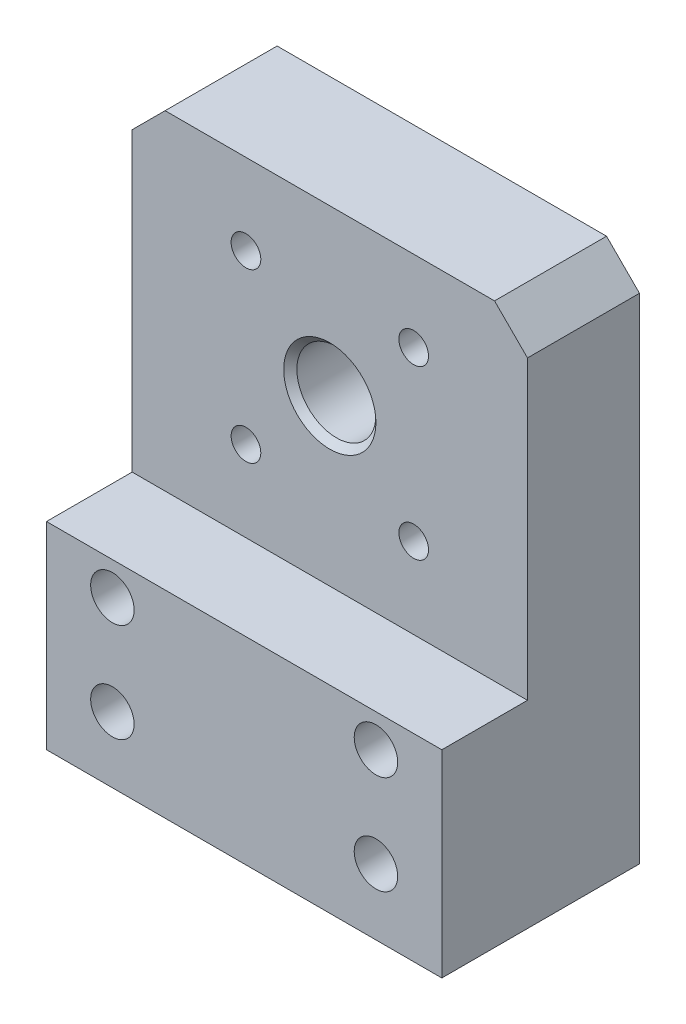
ISO-10303-21;
HEADER;
FILE_DESCRIPTION(('STEP AP214'),'2;1');
FILE_NAME('part.step','',(''),(''),'','','');
FILE_SCHEMA(('AUTOMOTIVE_DESIGN { 1 0 10303 214 1 1 1 1 }'));
ENDSEC;
DATA;
#1=APPLICATION_CONTEXT('core data for automotive mechanical design processes');
#2=APPLICATION_PROTOCOL_DEFINITION('international standard','automotive_design',2000,#1);
#3=PRODUCT_CONTEXT('',#1,'mechanical');
#4=PRODUCT('Part','Part','',(#3));
#5=PRODUCT_RELATED_PRODUCT_CATEGORY('part','',(#4));
#6=PRODUCT_DEFINITION_FORMATION('','',#4);
#7=PRODUCT_DEFINITION_CONTEXT('part definition',#1,'design');
#8=PRODUCT_DEFINITION('design','',#6,#7);
#9=PRODUCT_DEFINITION_SHAPE('','',#8);
#10=(LENGTH_UNIT() NAMED_UNIT(*) SI_UNIT(.MILLI.,.METRE.));
#11=(NAMED_UNIT(*) PLANE_ANGLE_UNIT() SI_UNIT($,.RADIAN.));
#12=(NAMED_UNIT(*) SI_UNIT($,.STERADIAN.) SOLID_ANGLE_UNIT());
#13=UNCERTAINTY_MEASURE_WITH_UNIT(LENGTH_MEASURE(1.E-05),#10,'distance_accuracy_value','');
#14=(GEOMETRIC_REPRESENTATION_CONTEXT(3) GLOBAL_UNCERTAINTY_ASSIGNED_CONTEXT((#13)) GLOBAL_UNIT_ASSIGNED_CONTEXT((#10,
#11,#12)) REPRESENTATION_CONTEXT('',''));
#15=CARTESIAN_POINT('',(0.,0.,0.));
#16=DIRECTION('',(0.,0.,1.));
#17=DIRECTION('',(1.,0.,0.));
#18=AXIS2_PLACEMENT_3D('',#15,#16,#17);
#19=CARTESIAN_POINT('',(0.,-2.98372437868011E-13,8.50000000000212));
#20=DIRECTION('',(0.,0.,-0.999999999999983));
#21=DIRECTION('',(-1.,0.,0.));
#22=AXIS2_PLACEMENT_3D('',#19,#20,#21);
#23=CYLINDRICAL_SURFACE('',#22,6.);
#24=CARTESIAN_POINT('',(0.,-5.34294830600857E-13,-3.));
#25=DIRECTION('',(0.,0.,-0.999999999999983));
#26=DIRECTION('',(-1.,0.,0.));
#27=AXIS2_PLACEMENT_3D('',#24,#25,#26);
#28=CIRCLE('',#27,6.);
#29=CARTESIAN_POINT('',(-6.,-2.85409716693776E-13,-3.));
#30=VERTEX_POINT('',#29);
#31=EDGE_CURVE('E187',#30,#30,#28,.T.);
#32=CARTESIAN_POINT('',(0.,0.,7.50000000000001));
#33=DIRECTION('',(0.,0.,0.999999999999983));
#34=DIRECTION('',(1.,0.,0.));
#35=AXIS2_PLACEMENT_3D('',#32,#33,#34);
#36=CIRCLE('',#35,6.);
#37=CARTESIAN_POINT('',(-6.,-2.85537218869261E-13,7.50000000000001));
#38=VERTEX_POINT('',#37);
#39=EDGE_CURVE('E174',#38,#38,#36,.T.);
#40=CARTESIAN_POINT('',(-6.,-2.85409716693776E-13,-3.));
#41=CARTESIAN_POINT('',(-6.,-2.85411044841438E-13,-2.890625));
#42=CARTESIAN_POINT('',(-6.,-2.85412372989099E-13,-2.78125));
#43=CARTESIAN_POINT('',(-6.,-2.85415029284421E-13,-2.5625));
#44=CARTESIAN_POINT('',(-6.,-2.85416357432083E-13,-2.453125));
#45=CARTESIAN_POINT('',(-6.,-2.85419013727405E-13,-2.234375));
#46=CARTESIAN_POINT('',(-6.,-2.85420341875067E-13,-2.125));
#47=CARTESIAN_POINT('',(-6.,-2.85422998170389E-13,-1.90625));
#48=CARTESIAN_POINT('',(-6.,-2.85424326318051E-13,-1.796875));
#49=CARTESIAN_POINT('',(-6.,-2.85426982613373E-13,-1.578125));
#50=CARTESIAN_POINT('',(-6.,-2.85428310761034E-13,-1.46875));
#51=CARTESIAN_POINT('',(-6.,-2.85430967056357E-13,-1.25));
#52=CARTESIAN_POINT('',(-6.,-2.85432295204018E-13,-1.140625));
#53=CARTESIAN_POINT('',(-6.,-2.85434951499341E-13,-0.921874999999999));
#54=CARTESIAN_POINT('',(-6.,-2.85436279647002E-13,-0.812499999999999));
#55=CARTESIAN_POINT('',(-6.,-2.85438935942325E-13,-0.593749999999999));
#56=CARTESIAN_POINT('',(-6.,-2.85440264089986E-13,-0.484374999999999));
#57=CARTESIAN_POINT('',(-6.,-2.85442920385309E-13,-0.265624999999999));
#58=CARTESIAN_POINT('',(-6.,-2.8544424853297E-13,-0.156249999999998));
#59=CARTESIAN_POINT('',(-6.,-2.85446904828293E-13,0.0625000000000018));
#60=CARTESIAN_POINT('',(-6.,-2.85448232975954E-13,0.171875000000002));
#61=CARTESIAN_POINT('',(-6.,-2.85450889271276E-13,0.390625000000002));
#62=CARTESIAN_POINT('',(-6.,-2.85452217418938E-13,0.500000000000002));
#63=CARTESIAN_POINT('',(-6.,-2.8545487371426E-13,0.718750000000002));
#64=CARTESIAN_POINT('',(-6.,-2.85456201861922E-13,0.828125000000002));
#65=CARTESIAN_POINT('',(-6.,-2.85458858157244E-13,1.046875));
#66=CARTESIAN_POINT('',(-6.,-2.85460186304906E-13,1.15625));
#67=CARTESIAN_POINT('',(-6.,-2.85462842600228E-13,1.375));
#68=CARTESIAN_POINT('',(-6.,-2.85464170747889E-13,1.484375));
#69=CARTESIAN_POINT('',(-6.,-2.85466827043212E-13,1.703125));
#70=CARTESIAN_POINT('',(-6.,-2.85468155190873E-13,1.8125));
#71=CARTESIAN_POINT('',(-6.,-2.85470811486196E-13,2.03125));
#72=CARTESIAN_POINT('',(-6.,-2.85472139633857E-13,2.140625));
#73=CARTESIAN_POINT('',(-6.,-2.8547479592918E-13,2.359375));
#74=CARTESIAN_POINT('',(-6.,-2.85476124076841E-13,2.46875));
#75=CARTESIAN_POINT('',(-6.,-2.85478780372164E-13,2.6875));
#76=CARTESIAN_POINT('',(-6.,-2.85480108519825E-13,2.796875));
#77=CARTESIAN_POINT('',(-6.,-2.85482764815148E-13,3.015625));
#78=CARTESIAN_POINT('',(-6.,-2.85484092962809E-13,3.125));
#79=CARTESIAN_POINT('',(-6.,-2.85486749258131E-13,3.34375));
#80=CARTESIAN_POINT('',(-6.,-2.85488077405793E-13,3.453125));
#81=CARTESIAN_POINT('',(-6.,-2.85490733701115E-13,3.671875));
#82=CARTESIAN_POINT('',(-6.,-2.85492061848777E-13,3.78125));
#83=CARTESIAN_POINT('',(-6.,-2.85494718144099E-13,4.));
#84=CARTESIAN_POINT('',(-6.,-2.8549604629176E-13,4.109375));
#85=CARTESIAN_POINT('',(-6.,-2.85498702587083E-13,4.328125));
#86=CARTESIAN_POINT('',(-6.,-2.85500030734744E-13,4.4375));
#87=CARTESIAN_POINT('',(-6.,-2.85502687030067E-13,4.65625000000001));
#88=CARTESIAN_POINT('',(-6.,-2.85504015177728E-13,4.765625));
#89=CARTESIAN_POINT('',(-6.,-2.85506671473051E-13,4.984375));
#90=CARTESIAN_POINT('',(-6.,-2.85507999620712E-13,5.09375000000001));
#91=CARTESIAN_POINT('',(-6.,-2.85510655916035E-13,5.31250000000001));
#92=CARTESIAN_POINT('',(-6.,-2.85511984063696E-13,5.421875));
#93=CARTESIAN_POINT('',(-6.,-2.85514640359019E-13,5.64062500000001));
#94=CARTESIAN_POINT('',(-6.,-2.8551596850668E-13,5.75000000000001));
#95=CARTESIAN_POINT('',(-6.,-2.85518624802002E-13,5.96875000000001));
#96=CARTESIAN_POINT('',(-6.,-2.85519952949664E-13,6.07812500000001));
#97=CARTESIAN_POINT('',(-6.,-2.85522609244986E-13,6.29687500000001));
#98=CARTESIAN_POINT('',(-6.,-2.85523937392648E-13,6.40625));
#99=CARTESIAN_POINT('',(-6.,-2.8552659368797E-13,6.62500000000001));
#100=CARTESIAN_POINT('',(-6.,-2.85527921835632E-13,6.73437500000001));
#101=CARTESIAN_POINT('',(-6.,-2.85530578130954E-13,6.95312500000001));
#102=CARTESIAN_POINT('',(-6.,-2.85531906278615E-13,7.06250000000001));
#103=CARTESIAN_POINT('',(-6.,-2.85534562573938E-13,7.28125000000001));
#104=CARTESIAN_POINT('',(-6.,-2.85535890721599E-13,7.39062500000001));
#105=CARTESIAN_POINT('',(-6.,-2.85537218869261E-13,7.50000000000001));
#106=B_SPLINE_CURVE_WITH_KNOTS('',3,(#40,#41,#42,#43,#44,#45,#46,#47,#48,#49,#50,#51,#52,#53,
#54,#55,#56,#57,#58,#59,#60,#61,#62,#63,#64,#65,#66,#67,#68,#69,#70,#71,#72,#73,#74,#75,#76,#77,
#78,#79,#80,#81,#82,#83,#84,#85,#86,#87,#88,#89,#90,#91,#92,#93,#94,#95,#96,#97,#98,#99,#100,
#101,#102,#103,#104,#105),.UNSPECIFIED.,.F.,.F.,(4,2,2,2,2,2,2,2,2,2,2,2,2,2,2,2,2,2,2,2,2,2,2,
2,2,2,2,2,2,2,2,2,4),(0.,0.328125,0.656250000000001,0.984375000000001,1.3125,1.640625,1.96875,
2.296875,2.625,2.953125,3.28125,3.609375,3.9375,4.265625,4.59375,4.921875,5.25,5.578125,5.90625,
6.234375,6.56250000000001,6.89062500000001,7.21875,7.54687500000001,7.87500000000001,
8.20312500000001,8.53125,8.859375,9.18750000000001,9.515625,9.84375000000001,10.171875,10.5),.UNSPECIFIED.);
#107=EDGE_CURVE('BSEAM26',#30,#38,#106,.T.);
#108=ORIENTED_EDGE('',*,*,#31,.T.);
#109=ORIENTED_EDGE('',*,*,#39,.T.);
#110=ORIENTED_EDGE('',*,*,#107,.T.);
#111=ORIENTED_EDGE('',*,*,#107,.F.);
#112=EDGE_LOOP('',(#108,#110,#109,#111));
#113=FACE_BOUND('',#112,.T.);
#114=ADVANCED_FACE('F26',(#113),#23,.F.);
#115=CARTESIAN_POINT('',(-29.9999999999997,-24.9999999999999,8.50000000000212));
#116=DIRECTION('',(0.,0.,0.999999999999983));
#117=DIRECTION('',(1.,0.,0.));
#118=AXIS2_PLACEMENT_3D('',#115,#116,#117);
#119=PLANE('',#118);
#120=CARTESIAN_POINT('',(0.,-2.98372437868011E-13,8.50000000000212));
#121=DIRECTION('',(0.,0.,0.999999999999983));
#122=DIRECTION('',(1.,0.,0.));
#123=AXIS2_PLACEMENT_3D('',#120,#121,#122);
#124=CIRCLE('',#123,7.);
#125=CARTESIAN_POINT('',(7.,-3.13332693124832E-13,8.50000000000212));
#126=VERTEX_POINT('',#125);
#127=EDGE_CURVE('E179',#126,#126,#124,.F.);
#128=ORIENTED_EDGE('',*,*,#127,.T.);
#129=EDGE_LOOP('',(#128));
#130=FACE_BOUND('',#129,.T.);
#131=CARTESIAN_POINT('',(-12.7279220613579,-12.7279220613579,8.50000000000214));
#132=DIRECTION('',(0.,0.,0.999999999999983));
#133=DIRECTION('',(1.,0.,0.));
#134=AXIS2_PLACEMENT_3D('',#131,#132,#133);
#135=CIRCLE('',#134,2.24999999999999);
#136=CARTESIAN_POINT('',(-14.9779220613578,-12.7279220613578,8.50000000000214));
#137=VERTEX_POINT('',#136);
#138=EDGE_CURVE('E373',#137,#137,#135,.T.);
#139=ORIENTED_EDGE('',*,*,#138,.F.);
#140=EDGE_LOOP('',(#139));
#141=FACE_BOUND('',#140,.T.);
#142=CARTESIAN_POINT('',(12.7279220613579,-12.7279220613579,8.50000000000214));
#143=DIRECTION('',(0.,0.,0.999999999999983));
#144=DIRECTION('',(1.,0.,0.));
#145=AXIS2_PLACEMENT_3D('',#142,#143,#144);
#146=CIRCLE('',#145,2.24999999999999);
#147=CARTESIAN_POINT('',(10.4779220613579,-12.7279220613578,8.50000000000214));
#148=VERTEX_POINT('',#147);
#149=EDGE_CURVE('E377',#148,#148,#146,.T.);
#150=ORIENTED_EDGE('',*,*,#149,.F.);
#151=EDGE_LOOP('',(#150));
#152=FACE_BOUND('',#151,.T.);
#153=CARTESIAN_POINT('',(-12.7279220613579,12.7279220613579,8.50000000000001));
#154=DIRECTION('',(0.,0.,0.999999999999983));
#155=DIRECTION('',(1.,0.,0.));
#156=AXIS2_PLACEMENT_3D('',#153,#154,#155);
#157=CIRCLE('',#156,2.24999999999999);
#158=CARTESIAN_POINT('',(-14.9779220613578,12.7279220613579,8.50000000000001));
#159=VERTEX_POINT('',#158);
#160=EDGE_CURVE('E381',#159,#159,#157,.T.);
#161=ORIENTED_EDGE('',*,*,#160,.F.);
#162=EDGE_LOOP('',(#161));
#163=FACE_BOUND('',#162,.T.);
#164=CARTESIAN_POINT('',(12.7279220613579,12.7279220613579,8.50000000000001));
#165=DIRECTION('',(0.,0.,0.999999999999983));
#166=DIRECTION('',(1.,0.,0.));
#167=AXIS2_PLACEMENT_3D('',#164,#165,#166);
#168=CIRCLE('',#167,2.24999999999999);
#169=CARTESIAN_POINT('',(10.4779220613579,12.7279220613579,8.50000000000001));
#170=VERTEX_POINT('',#169);
#171=EDGE_CURVE('E384',#170,#170,#168,.T.);
#172=ORIENTED_EDGE('',*,*,#171,.F.);
#173=EDGE_LOOP('',(#172));
#174=FACE_BOUND('',#173,.T.);
#175=DIRECTION('',(0.,1.,0.));
#176=VECTOR('',#175,1.);
#177=CARTESIAN_POINT('',(30.0000000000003,25.,8.50000000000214));
#178=LINE('',#177,#176);
#179=CARTESIAN_POINT('',(30.0000000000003,-25.,8.50000000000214));
#180=VERTEX_POINT('',#179);
#181=CARTESIAN_POINT('',(30.0000000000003,20.,8.50000000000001));
#182=VERTEX_POINT('',#181);
#183=EDGE_CURVE('E153',#180,#182,#178,.T.);
#184=ORIENTED_EDGE('',*,*,#183,.T.);
#185=DIRECTION('',(0.707106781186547,-0.707106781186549,0.));
#186=VECTOR('',#185,1.);
#187=CARTESIAN_POINT('',(22.5000000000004,27.4999999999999,8.50000000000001));
#188=LINE('',#187,#186);
#189=CARTESIAN_POINT('',(25.0000000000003,25.,8.50000000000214));
#190=VERTEX_POINT('',#189);
#191=EDGE_CURVE('E34',#182,#190,#188,.F.);
#192=ORIENTED_EDGE('',*,*,#191,.T.);
#193=DIRECTION('',(-1.,0.,0.));
#194=VECTOR('',#193,1.);
#195=CARTESIAN_POINT('',(-29.9999999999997,25.,8.50000000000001));
#196=LINE('',#195,#194);
#197=CARTESIAN_POINT('',(-24.9999999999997,25.,8.50000000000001));
#198=VERTEX_POINT('',#197);
#199=EDGE_CURVE('E148',#190,#198,#196,.T.);
#200=ORIENTED_EDGE('',*,*,#199,.T.);
#201=DIRECTION('',(0.707106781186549,0.707106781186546,0.));
#202=VECTOR('',#201,1.);
#203=CARTESIAN_POINT('',(-52.5,-2.49999999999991,8.50000000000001));
#204=LINE('',#203,#202);
#205=CARTESIAN_POINT('',(-29.9999999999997,20.,8.50000000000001));
#206=VERTEX_POINT('',#205);
#207=EDGE_CURVE('E41',#198,#206,#204,.F.);
#208=ORIENTED_EDGE('',*,*,#207,.T.);
#209=DIRECTION('',(0.,-1.,0.));
#210=VECTOR('',#209,1.);
#211=CARTESIAN_POINT('',(-29.9999999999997,25.,8.50000000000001));
#212=LINE('',#211,#210);
#213=CARTESIAN_POINT('',(-29.9999999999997,-24.9999999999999,8.50000000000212));
#214=VERTEX_POINT('',#213);
#215=EDGE_CURVE('E145',#206,#214,#212,.T.);
#216=ORIENTED_EDGE('',*,*,#215,.T.);
#217=DIRECTION('',(1.,0.,0.));
#218=VECTOR('',#217,1.);
#219=CARTESIAN_POINT('',(-29.9999999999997,-24.9999999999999,8.50000000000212));
#220=LINE('',#219,#218);
#221=EDGE_CURVE('E150',#214,#180,#220,.T.);
#222=ORIENTED_EDGE('',*,*,#221,.T.);
#223=EDGE_LOOP('',(#184,#192,#200,#208,#216,#222));
#224=FACE_BOUND('',#223,.T.);
#225=ADVANCED_FACE('F165',(#130,#141,#152,#163,#174,#224),#119,.T.);
#226=CARTESIAN_POINT('',(-30.,-25.,-8.50000000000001));
#227=DIRECTION('',(0.,0.,0.999999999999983));
#228=DIRECTION('',(1.,0.,0.));
#229=AXIS2_PLACEMENT_3D('',#226,#227,#228);
#230=PLANE('',#229);
#231=CARTESIAN_POINT('',(0.,-5.34294830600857E-13,-8.49999999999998));
#232=DIRECTION('',(0.,0.,-0.999999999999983));
#233=DIRECTION('',(-1.,0.,0.));
#234=AXIS2_PLACEMENT_3D('',#231,#232,#233);
#235=CIRCLE('',#234,12.5);
#236=CARTESIAN_POINT('',(-12.5,0.,-8.49999999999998));
#237=VERTEX_POINT('',#236);
#238=EDGE_CURVE('E438',#237,#237,#235,.T.);
#239=ORIENTED_EDGE('',*,*,#238,.F.);
#240=EDGE_LOOP('',(#239));
#241=FACE_BOUND('',#240,.T.);
#242=CARTESIAN_POINT('',(-12.7279220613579,-12.7279220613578,-8.49999999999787));
#243=DIRECTION('',(0.,0.,-0.999999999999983));
#244=DIRECTION('',(-1.,0.,0.));
#245=AXIS2_PLACEMENT_3D('',#242,#243,#244);
#246=CIRCLE('',#245,2.24999999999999);
#247=CARTESIAN_POINT('',(-14.9779220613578,-12.7279220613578,-8.49999999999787));
#248=VERTEX_POINT('',#247);
#249=EDGE_CURVE('E432',#248,#248,#246,.T.);
#250=ORIENTED_EDGE('',*,*,#249,.F.);
#251=EDGE_LOOP('',(#250));
#252=FACE_BOUND('',#251,.T.);
#253=CARTESIAN_POINT('',(12.7279220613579,-12.7279220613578,-8.49999999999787));
#254=DIRECTION('',(0.,0.,-0.999999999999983));
#255=DIRECTION('',(-1.,0.,0.));
#256=AXIS2_PLACEMENT_3D('',#253,#254,#255);
#257=CIRCLE('',#256,2.24999999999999);
#258=CARTESIAN_POINT('',(10.4779220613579,-12.7279220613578,-8.49999999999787));
#259=VERTEX_POINT('',#258);
#260=EDGE_CURVE('E428',#259,#259,#257,.T.);
#261=ORIENTED_EDGE('',*,*,#260,.F.);
#262=EDGE_LOOP('',(#261));
#263=FACE_BOUND('',#262,.T.);
#264=CARTESIAN_POINT('',(-12.7279220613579,12.7279220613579,-8.50000000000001));
#265=DIRECTION('',(0.,0.,-0.999999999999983));
#266=DIRECTION('',(-1.,0.,0.));
#267=AXIS2_PLACEMENT_3D('',#264,#265,#266);
#268=CIRCLE('',#267,2.24999999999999);
#269=CARTESIAN_POINT('',(-14.9779220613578,12.7279220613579,-8.50000000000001));
#270=VERTEX_POINT('',#269);
#271=EDGE_CURVE('E424',#270,#270,#268,.T.);
#272=ORIENTED_EDGE('',*,*,#271,.F.);
#273=EDGE_LOOP('',(#272));
#274=FACE_BOUND('',#273,.T.);
#275=CARTESIAN_POINT('',(12.7279220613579,12.7279220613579,-8.50000000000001));
#276=DIRECTION('',(0.,0.,-0.999999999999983));
#277=DIRECTION('',(-1.,0.,0.));
#278=AXIS2_PLACEMENT_3D('',#275,#276,#277);
#279=CIRCLE('',#278,2.24999999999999);
#280=CARTESIAN_POINT('',(10.4779220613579,12.7279220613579,-8.50000000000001));
#281=VERTEX_POINT('',#280);
#282=EDGE_CURVE('E386',#281,#281,#279,.T.);
#283=ORIENTED_EDGE('',*,*,#282,.F.);
#284=EDGE_LOOP('',(#283));
#285=FACE_BOUND('',#284,.T.);
#286=CARTESIAN_POINT('',(20.,-30.,-8.50000000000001));
#287=DIRECTION('',(0.,0.,-0.999999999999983));
#288=DIRECTION('',(-1.,0.,0.));
#289=AXIS2_PLACEMENT_3D('',#286,#287,#288);
#290=CIRCLE('',#289,5.49999999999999);
#291=CARTESIAN_POINT('',(14.5,-30.,-8.50000000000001));
#292=VERTEX_POINT('',#291);
#293=EDGE_CURVE('E196',#292,#292,#290,.T.);
#294=ORIENTED_EDGE('',*,*,#293,.F.);
#295=EDGE_LOOP('',(#294));
#296=FACE_BOUND('',#295,.T.);
#297=CARTESIAN_POINT('',(-20.,-30.,-8.50000000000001));
#298=DIRECTION('',(0.,0.,-0.999999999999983));
#299=DIRECTION('',(-1.,0.,0.));
#300=AXIS2_PLACEMENT_3D('',#297,#298,#299);
#301=CIRCLE('',#300,5.49999999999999);
#302=CARTESIAN_POINT('',(-25.5,-30.,-8.50000000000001));
#303=VERTEX_POINT('',#302);
#304=EDGE_CURVE('E200',#303,#303,#301,.T.);
#305=ORIENTED_EDGE('',*,*,#304,.F.);
#306=EDGE_LOOP('',(#305));
#307=FACE_BOUND('',#306,.T.);
#308=CARTESIAN_POINT('',(-20.,-45.,-8.50000000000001));
#309=DIRECTION('',(0.,0.,-0.999999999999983));
#310=DIRECTION('',(-1.,0.,0.));
#311=AXIS2_PLACEMENT_3D('',#308,#309,#310);
#312=CIRCLE('',#311,5.49999999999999);
#313=CARTESIAN_POINT('',(-25.5,-45.,-8.50000000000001));
#314=VERTEX_POINT('',#313);
#315=EDGE_CURVE('E204',#314,#314,#312,.T.);
#316=ORIENTED_EDGE('',*,*,#315,.F.);
#317=EDGE_LOOP('',(#316));
#318=FACE_BOUND('',#317,.T.);
#319=CARTESIAN_POINT('',(20.,-45.,-8.50000000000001));
#320=DIRECTION('',(0.,0.,-0.999999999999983));
#321=DIRECTION('',(-1.,0.,0.));
#322=AXIS2_PLACEMENT_3D('',#319,#320,#321);
#323=CIRCLE('',#322,5.49999999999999);
#324=CARTESIAN_POINT('',(14.5,-45.,-8.50000000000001));
#325=VERTEX_POINT('',#324);
#326=EDGE_CURVE('E122',#325,#325,#323,.T.);
#327=ORIENTED_EDGE('',*,*,#326,.F.);
#328=EDGE_LOOP('',(#327));
#329=FACE_BOUND('',#328,.T.);
#330=DIRECTION('',(-1.,0.,0.));
#331=VECTOR('',#330,1.);
#332=CARTESIAN_POINT('',(-30.,25.,-8.50000000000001));
#333=LINE('',#332,#331);
#334=CARTESIAN_POINT('',(25.,25.,-8.49999999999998));
#335=VERTEX_POINT('',#334);
#336=CARTESIAN_POINT('',(-25.,25.,-8.50000000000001));
#337=VERTEX_POINT('',#336);
#338=EDGE_CURVE('E101',#335,#337,#333,.T.);
#339=ORIENTED_EDGE('',*,*,#338,.F.);
#340=DIRECTION('',(-0.707106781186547,0.707106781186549,0.));
#341=VECTOR('',#340,1.);
#342=CARTESIAN_POINT('',(25.,25.,-8.49999999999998));
#343=LINE('',#342,#341);
#344=CARTESIAN_POINT('',(30.,20.,-8.50000000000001));
#345=VERTEX_POINT('',#344);
#346=EDGE_CURVE('E100',#335,#345,#343,.F.);
#347=ORIENTED_EDGE('',*,*,#346,.T.);
#348=DIRECTION('',(0.,1.,0.));
#349=VECTOR('',#348,1.);
#350=CARTESIAN_POINT('',(30.,25.,-8.49999999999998));
#351=LINE('',#350,#349);
#352=CARTESIAN_POINT('',(30.0000000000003,-55.,-8.50000000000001));
#353=VERTEX_POINT('',#352);
#354=EDGE_CURVE('E93',#353,#345,#351,.T.);
#355=ORIENTED_EDGE('',*,*,#354,.F.);
#356=DIRECTION('',(-1.,0.,0.));
#357=VECTOR('',#356,1.);
#358=CARTESIAN_POINT('',(30.0000000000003,-55.,-8.50000000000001));
#359=LINE('',#358,#357);
#360=CARTESIAN_POINT('',(-29.9999999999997,-55.,-8.50000000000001));
#361=VERTEX_POINT('',#360);
#362=EDGE_CURVE('E99',#353,#361,#359,.T.);
#363=ORIENTED_EDGE('',*,*,#362,.T.);
#364=DIRECTION('',(0.,-1.,0.));
#365=VECTOR('',#364,1.);
#366=CARTESIAN_POINT('',(-30.,25.,-8.50000000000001));
#367=LINE('',#366,#365);
#368=CARTESIAN_POINT('',(-30.,20.,-8.50000000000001));
#369=VERTEX_POINT('',#368);
#370=EDGE_CURVE('E102',#369,#361,#367,.T.);
#371=ORIENTED_EDGE('',*,*,#370,.F.);
#372=DIRECTION('',(-0.707106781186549,-0.707106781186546,0.));
#373=VECTOR('',#372,1.);
#374=CARTESIAN_POINT('',(-30.,20.,-8.50000000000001));
#375=LINE('',#374,#373);
#376=EDGE_CURVE('E176',#369,#337,#375,.F.);
#377=ORIENTED_EDGE('',*,*,#376,.T.);
#378=EDGE_LOOP('',(#339,#347,#355,#363,#371,#377));
#379=FACE_BOUND('',#378,.T.);
#380=ADVANCED_FACE('F96',(#241,#252,#263,#274,#285,#296,#307,#318,#329,#379),#230,.F.);
#381=CARTESIAN_POINT('',(-29.9999999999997,25.,8.50000000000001));
#382=DIRECTION('',(1.,0.,0.));
#383=DIRECTION('',(0.,1.,0.));
#384=AXIS2_PLACEMENT_3D('',#381,#382,#383);
#385=PLANE('',#384);
#386=ORIENTED_EDGE('',*,*,#215,.F.);
#387=DIRECTION('',(0.,0.,-0.999999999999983));
#388=VECTOR('',#387,1.);
#389=CARTESIAN_POINT('',(-29.9999999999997,20.,8.50000000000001));
#390=LINE('',#389,#388);
#391=EDGE_CURVE('E11',#206,#369,#390,.T.);
#392=ORIENTED_EDGE('',*,*,#391,.T.);
#393=ORIENTED_EDGE('',*,*,#370,.T.);
#394=DIRECTION('',(0.,0.,-0.999999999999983));
#395=VECTOR('',#394,1.);
#396=CARTESIAN_POINT('',(-29.9999999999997,-55.,21.5));
#397=LINE('',#396,#395);
#398=CARTESIAN_POINT('',(-29.9999999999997,-55.,21.5));
#399=VERTEX_POINT('',#398);
#400=EDGE_CURVE('E112',#399,#361,#397,.T.);
#401=ORIENTED_EDGE('',*,*,#400,.F.);
#402=DIRECTION('',(0.,1.,0.));
#403=VECTOR('',#402,1.);
#404=CARTESIAN_POINT('',(-29.9999999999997,-55.,21.5));
#405=LINE('',#404,#403);
#406=CARTESIAN_POINT('',(-30.,-25.,21.5));
#407=VERTEX_POINT('',#406);
#408=EDGE_CURVE('E128',#399,#407,#405,.T.);
#409=ORIENTED_EDGE('',*,*,#408,.T.);
#410=DIRECTION('',(0.,0.,-0.999999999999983));
#411=VECTOR('',#410,1.);
#412=CARTESIAN_POINT('',(-30.,-25.,21.5));
#413=LINE('',#412,#411);
#414=EDGE_CURVE('E141',#407,#214,#413,.T.);
#415=ORIENTED_EDGE('',*,*,#414,.T.);
#416=EDGE_LOOP('',(#386,#392,#393,#401,#409,#415));
#417=FACE_BOUND('',#416,.T.);
#418=ADVANCED_FACE('F28',(#417),#385,.F.);
#419=CARTESIAN_POINT('',(30.0000000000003,25.,8.50000000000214));
#420=DIRECTION('',(-1.,0.,0.));
#421=DIRECTION('',(0.,-1.,0.));
#422=AXIS2_PLACEMENT_3D('',#419,#420,#421);
#423=PLANE('',#422);
#424=ORIENTED_EDGE('',*,*,#354,.T.);
#425=DIRECTION('',(0.,0.,0.999999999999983));
#426=VECTOR('',#425,1.);
#427=CARTESIAN_POINT('',(30.0000000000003,20.,8.50000000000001));
#428=LINE('',#427,#426);
#429=EDGE_CURVE('E49',#345,#182,#428,.T.);
#430=ORIENTED_EDGE('',*,*,#429,.T.);
#431=ORIENTED_EDGE('',*,*,#183,.F.);
#432=DIRECTION('',(0.,0.,-0.999999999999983));
#433=VECTOR('',#432,1.);
#434=CARTESIAN_POINT('',(30.,-25.,21.5));
#435=LINE('',#434,#433);
#436=CARTESIAN_POINT('',(30.,-25.,21.5));
#437=VERTEX_POINT('',#436);
#438=EDGE_CURVE('E138',#437,#180,#435,.T.);
#439=ORIENTED_EDGE('',*,*,#438,.F.);
#440=DIRECTION('',(0.,-1.,0.));
#441=VECTOR('',#440,1.);
#442=CARTESIAN_POINT('',(30.0000000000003,-55.,21.5));
#443=LINE('',#442,#441);
#444=CARTESIAN_POINT('',(30.0000000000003,-55.,21.5));
#445=VERTEX_POINT('',#444);
#446=EDGE_CURVE('E108',#437,#445,#443,.T.);
#447=ORIENTED_EDGE('',*,*,#446,.T.);
#448=DIRECTION('',(0.,0.,-0.999999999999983));
#449=VECTOR('',#448,1.);
#450=CARTESIAN_POINT('',(30.0000000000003,-55.,21.5));
#451=LINE('',#450,#449);
#452=EDGE_CURVE('E105',#445,#353,#451,.T.);
#453=ORIENTED_EDGE('',*,*,#452,.T.);
#454=EDGE_LOOP('',(#424,#430,#431,#439,#447,#453));
#455=FACE_BOUND('',#454,.T.);
#456=ADVANCED_FACE('F106',(#455),#423,.F.);
#457=CARTESIAN_POINT('',(-29.9999999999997,25.,8.50000000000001));
#458=DIRECTION('',(0.,-1.,0.));
#459=DIRECTION('',(0.,0.,-0.999999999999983));
#460=AXIS2_PLACEMENT_3D('',#457,#458,#459);
#461=PLANE('',#460);
#462=ORIENTED_EDGE('',*,*,#199,.F.);
#463=DIRECTION('',(0.,0.,-0.999999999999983));
#464=VECTOR('',#463,1.);
#465=CARTESIAN_POINT('',(25.0000000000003,25.,8.50000000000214));
#466=LINE('',#465,#464);
#467=EDGE_CURVE('E171',#190,#335,#466,.T.);
#468=ORIENTED_EDGE('',*,*,#467,.T.);
#469=ORIENTED_EDGE('',*,*,#338,.T.);
#470=DIRECTION('',(0.,0.,0.999999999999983));
#471=VECTOR('',#470,1.);
#472=CARTESIAN_POINT('',(-24.9999999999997,25.,8.50000000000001));
#473=LINE('',#472,#471);
#474=EDGE_CURVE('E173',#337,#198,#473,.T.);
#475=ORIENTED_EDGE('',*,*,#474,.T.);
#476=EDGE_LOOP('',(#462,#468,#469,#475));
#477=FACE_BOUND('',#476,.T.);
#478=ADVANCED_FACE('F170',(#477),#461,.F.);
#479=CARTESIAN_POINT('',(30.,-25.,21.5));
#480=DIRECTION('',(0.,1.,0.));
#481=DIRECTION('',(0.,0.,0.999999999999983));
#482=AXIS2_PLACEMENT_3D('',#479,#480,#481);
#483=PLANE('',#482);
#484=ORIENTED_EDGE('',*,*,#221,.F.);
#485=ORIENTED_EDGE('',*,*,#414,.F.);
#486=DIRECTION('',(1.,0.,0.));
#487=VECTOR('',#486,1.);
#488=CARTESIAN_POINT('',(30.,-25.,21.5));
#489=LINE('',#488,#487);
#490=EDGE_CURVE('E113',#407,#437,#489,.T.);
#491=ORIENTED_EDGE('',*,*,#490,.T.);
#492=ORIENTED_EDGE('',*,*,#438,.T.);
#493=EDGE_LOOP('',(#484,#485,#491,#492));
#494=FACE_BOUND('',#493,.T.);
#495=ADVANCED_FACE('F252',(#494),#483,.T.);
#496=CARTESIAN_POINT('',(30.0000000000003,-55.,21.5));
#497=DIRECTION('',(0.,-1.,0.));
#498=DIRECTION('',(0.,0.,-0.999999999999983));
#499=AXIS2_PLACEMENT_3D('',#496,#497,#498);
#500=PLANE('',#499);
#501=ORIENTED_EDGE('',*,*,#362,.F.);
#502=ORIENTED_EDGE('',*,*,#452,.F.);
#503=DIRECTION('',(-1.,0.,0.));
#504=VECTOR('',#503,1.);
#505=CARTESIAN_POINT('',(30.0000000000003,-55.,21.5));
#506=LINE('',#505,#504);
#507=EDGE_CURVE('E119',#445,#399,#506,.T.);
#508=ORIENTED_EDGE('',*,*,#507,.T.);
#509=ORIENTED_EDGE('',*,*,#400,.T.);
#510=EDGE_LOOP('',(#501,#502,#508,#509));
#511=FACE_BOUND('',#510,.T.);
#512=ADVANCED_FACE('F116',(#511),#500,.T.);
#513=CARTESIAN_POINT('',(30.,-25.,21.5));
#514=DIRECTION('',(0.,0.,0.999999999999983));
#515=DIRECTION('',(1.,0.,0.));
#516=AXIS2_PLACEMENT_3D('',#513,#514,#515);
#517=PLANE('',#516);
#518=CARTESIAN_POINT('',(20.,-30.,21.5));
#519=DIRECTION('',(0.,0.,0.999999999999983));
#520=DIRECTION('',(1.,0.,0.));
#521=AXIS2_PLACEMENT_3D('',#518,#519,#520);
#522=CIRCLE('',#521,3.3);
#523=CARTESIAN_POINT('',(16.7,-30.,21.5));
#524=VERTEX_POINT('',#523);
#525=EDGE_CURVE('E192',#524,#524,#522,.T.);
#526=ORIENTED_EDGE('',*,*,#525,.F.);
#527=EDGE_LOOP('',(#526));
#528=FACE_BOUND('',#527,.T.);
#529=CARTESIAN_POINT('',(-20.,-30.,21.5));
#530=DIRECTION('',(0.,0.,0.999999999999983));
#531=DIRECTION('',(1.,0.,0.));
#532=AXIS2_PLACEMENT_3D('',#529,#530,#531);
#533=CIRCLE('',#532,3.3);
#534=CARTESIAN_POINT('',(-23.3,-30.,21.5));
#535=VERTEX_POINT('',#534);
#536=EDGE_CURVE('E197',#535,#535,#533,.T.);
#537=ORIENTED_EDGE('',*,*,#536,.F.);
#538=EDGE_LOOP('',(#537));
#539=FACE_BOUND('',#538,.T.);
#540=CARTESIAN_POINT('',(-20.,-45.,21.5000000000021));
#541=DIRECTION('',(0.,0.,0.999999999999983));
#542=DIRECTION('',(1.,0.,0.));
#543=AXIS2_PLACEMENT_3D('',#540,#541,#542);
#544=CIRCLE('',#543,3.3);
#545=CARTESIAN_POINT('',(-23.3,-45.,21.5000000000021));
#546=VERTEX_POINT('',#545);
#547=EDGE_CURVE('E201',#546,#546,#544,.T.);
#548=ORIENTED_EDGE('',*,*,#547,.F.);
#549=EDGE_LOOP('',(#548));
#550=FACE_BOUND('',#549,.T.);
#551=CARTESIAN_POINT('',(20.,-45.,21.5000000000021));
#552=DIRECTION('',(0.,0.,0.999999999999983));
#553=DIRECTION('',(1.,0.,0.));
#554=AXIS2_PLACEMENT_3D('',#551,#552,#553);
#555=CIRCLE('',#554,3.3);
#556=CARTESIAN_POINT('',(16.7,-45.,21.5000000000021));
#557=VERTEX_POINT('',#556);
#558=EDGE_CURVE('E117',#557,#557,#555,.T.);
#559=ORIENTED_EDGE('',*,*,#558,.F.);
#560=EDGE_LOOP('',(#559));
#561=FACE_BOUND('',#560,.T.);
#562=ORIENTED_EDGE('',*,*,#446,.F.);
#563=ORIENTED_EDGE('',*,*,#490,.F.);
#564=ORIENTED_EDGE('',*,*,#408,.F.);
#565=ORIENTED_EDGE('',*,*,#507,.F.);
#566=EDGE_LOOP('',(#562,#563,#564,#565));
#567=FACE_BOUND('',#566,.T.);
#568=ADVANCED_FACE('F251',(#528,#539,#550,#561,#567),#517,.T.);
#569=CARTESIAN_POINT('',(20.,-45.,-8.50000000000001));
#570=DIRECTION('',(0.,0.,-0.999999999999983));
#571=DIRECTION('',(-1.,0.,0.));
#572=AXIS2_PLACEMENT_3D('',#569,#570,#571);
#573=CYLINDRICAL_SURFACE('',#572,5.49999999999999);
#574=CARTESIAN_POINT('',(20.,-45.,-2.5));
#575=DIRECTION('',(0.,0.,-0.999999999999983));
#576=DIRECTION('',(-1.,0.,0.));
#577=AXIS2_PLACEMENT_3D('',#574,#575,#576);
#578=CIRCLE('',#577,5.49999999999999);
#579=CARTESIAN_POINT('',(14.5,-45.,-2.5));
#580=VERTEX_POINT('',#579);
#581=EDGE_CURVE('E208',#580,#580,#578,.T.);
#582=CARTESIAN_POINT('',(14.5,-45.,-2.5));
#583=CARTESIAN_POINT('',(14.5,-45.,-2.5625));
#584=CARTESIAN_POINT('',(14.5,-45.,-2.625));
#585=CARTESIAN_POINT('',(14.5,-45.,-2.75));
#586=CARTESIAN_POINT('',(14.5,-45.,-2.8125));
#587=CARTESIAN_POINT('',(14.5,-45.,-2.9375));
#588=CARTESIAN_POINT('',(14.5,-45.,-3.));
#589=CARTESIAN_POINT('',(14.5,-45.,-3.125));
#590=CARTESIAN_POINT('',(14.5,-45.,-3.1875));
#591=CARTESIAN_POINT('',(14.5,-45.,-3.3125));
#592=CARTESIAN_POINT('',(14.5,-45.,-3.375));
#593=CARTESIAN_POINT('',(14.5,-45.,-3.5));
#594=CARTESIAN_POINT('',(14.5,-45.,-3.5625));
#595=CARTESIAN_POINT('',(14.5,-45.,-3.6875));
#596=CARTESIAN_POINT('',(14.5,-45.,-3.75));
#597=CARTESIAN_POINT('',(14.5,-45.,-3.875));
#598=CARTESIAN_POINT('',(14.5,-45.,-3.9375));
#599=CARTESIAN_POINT('',(14.5,-45.,-4.0625));
#600=CARTESIAN_POINT('',(14.5,-45.,-4.125));
#601=CARTESIAN_POINT('',(14.5,-45.,-4.25));
#602=CARTESIAN_POINT('',(14.5,-45.,-4.3125));
#603=CARTESIAN_POINT('',(14.5,-45.,-4.4375));
#604=CARTESIAN_POINT('',(14.5,-45.,-4.5));
#605=CARTESIAN_POINT('',(14.5,-45.,-4.625));
#606=CARTESIAN_POINT('',(14.5,-45.,-4.6875));
#607=CARTESIAN_POINT('',(14.5,-45.,-4.8125));
#608=CARTESIAN_POINT('',(14.5,-45.,-4.875));
#609=CARTESIAN_POINT('',(14.5,-45.,-5.));
#610=CARTESIAN_POINT('',(14.5,-45.,-5.0625));
#611=CARTESIAN_POINT('',(14.5,-45.,-5.1875));
#612=CARTESIAN_POINT('',(14.5,-45.,-5.25));
#613=CARTESIAN_POINT('',(14.5,-45.,-5.375));
#614=CARTESIAN_POINT('',(14.5,-45.,-5.4375));
#615=CARTESIAN_POINT('',(14.5,-45.,-5.56250000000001));
#616=CARTESIAN_POINT('',(14.5,-45.,-5.62500000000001));
#617=CARTESIAN_POINT('',(14.5,-45.,-5.75000000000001));
#618=CARTESIAN_POINT('',(14.5,-45.,-5.81250000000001));
#619=CARTESIAN_POINT('',(14.5,-45.,-5.93750000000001));
#620=CARTESIAN_POINT('',(14.5,-45.,-6.00000000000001));
#621=CARTESIAN_POINT('',(14.5,-45.,-6.12500000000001));
#622=CARTESIAN_POINT('',(14.5,-45.,-6.18750000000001));
#623=CARTESIAN_POINT('',(14.5,-45.,-6.31250000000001));
#624=CARTESIAN_POINT('',(14.5,-45.,-6.37500000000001));
#625=CARTESIAN_POINT('',(14.5,-45.,-6.50000000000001));
#626=CARTESIAN_POINT('',(14.5,-45.,-6.56250000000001));
#627=CARTESIAN_POINT('',(14.5,-45.,-6.68750000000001));
#628=CARTESIAN_POINT('',(14.5,-45.,-6.75000000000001));
#629=CARTESIAN_POINT('',(14.5,-45.,-6.87500000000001));
#630=CARTESIAN_POINT('',(14.5,-45.,-6.93750000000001));
#631=CARTESIAN_POINT('',(14.5,-45.,-7.06250000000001));
#632=CARTESIAN_POINT('',(14.5,-45.,-7.12500000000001));
#633=CARTESIAN_POINT('',(14.5,-45.,-7.25000000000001));
#634=CARTESIAN_POINT('',(14.5,-45.,-7.31250000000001));
#635=CARTESIAN_POINT('',(14.5,-45.,-7.43750000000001));
#636=CARTESIAN_POINT('',(14.5,-45.,-7.50000000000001));
#637=CARTESIAN_POINT('',(14.5,-45.,-7.62500000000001));
#638=CARTESIAN_POINT('',(14.5,-45.,-7.68750000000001));
#639=CARTESIAN_POINT('',(14.5,-45.,-7.81250000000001));
#640=CARTESIAN_POINT('',(14.5,-45.,-7.87500000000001));
#641=CARTESIAN_POINT('',(14.5,-45.,-8.00000000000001));
#642=CARTESIAN_POINT('',(14.5,-45.,-8.06250000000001));
#643=CARTESIAN_POINT('',(14.5,-45.,-8.18750000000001));
#644=CARTESIAN_POINT('',(14.5,-45.,-8.25000000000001));
#645=CARTESIAN_POINT('',(14.5,-45.,-8.37500000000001));
#646=CARTESIAN_POINT('',(14.5,-45.,-8.43750000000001));
#647=CARTESIAN_POINT('',(14.5,-45.,-8.50000000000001));
#648=B_SPLINE_CURVE_WITH_KNOTS('',3,(#582,#583,#584,#585,#586,#587,#588,#589,#590,#591,#592,
#593,#594,#595,#596,#597,#598,#599,#600,#601,#602,#603,#604,#605,#606,#607,#608,#609,#610,#611,
#612,#613,#614,#615,#616,#617,#618,#619,#620,#621,#622,#623,#624,#625,#626,#627,#628,#629,#630,
#631,#632,#633,#634,#635,#636,#637,#638,#639,#640,#641,#642,#643,#644,#645,#646,#647),
.UNSPECIFIED.,.F.,.F.,(4,2,2,2,2,2,2,2,2,2,2,2,2,2,2,2,2,2,2,2,2,2,2,2,2,2,2,2,2,2,2,2,4),(0.,
0.187500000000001,0.375,0.5625,0.750000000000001,0.937500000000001,1.125,1.3125,1.5,1.6875,
1.875,2.0625,2.25,2.4375,2.625,2.8125,3.,3.1875,3.375,3.5625,3.75,3.9375,4.125,4.3125,4.5,
4.6875,4.875,5.0625,5.25,5.4375,5.62500000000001,5.8125,6.00000000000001),.UNSPECIFIED.);
#649=EDGE_CURVE('BSEAM224',#580,#325,#648,.T.);
#650=ORIENTED_EDGE('',*,*,#581,.F.);
#651=ORIENTED_EDGE('',*,*,#326,.T.);
#652=ORIENTED_EDGE('',*,*,#649,.T.);
#653=ORIENTED_EDGE('',*,*,#649,.F.);
#654=EDGE_LOOP('',(#650,#652,#651,#653));
#655=FACE_BOUND('',#654,.T.);
#656=ADVANCED_FACE('F224',(#655),#573,.F.);
#657=CARTESIAN_POINT('',(23.3,-45.,-2.5));
#658=DIRECTION('',(0.,0.,0.999999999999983));
#659=DIRECTION('',(1.,0.,0.));
#660=AXIS2_PLACEMENT_3D('',#657,#658,#659);
#661=PLANE('',#660);
#662=CARTESIAN_POINT('',(20.,-45.,-2.5));
#663=DIRECTION('',(0.,0.,-0.999999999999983));
#664=DIRECTION('',(-1.,0.,0.));
#665=AXIS2_PLACEMENT_3D('',#662,#663,#664);
#666=CIRCLE('',#665,3.3);
#667=CARTESIAN_POINT('',(16.7,-45.,-2.5));
#668=VERTEX_POINT('',#667);
#669=EDGE_CURVE('E203',#668,#668,#666,.T.);
#670=ORIENTED_EDGE('',*,*,#669,.F.);
#671=EDGE_LOOP('',(#670));
#672=FACE_BOUND('',#671,.T.);
#673=ORIENTED_EDGE('',*,*,#581,.T.);
#674=EDGE_LOOP('',(#673));
#675=FACE_BOUND('',#674,.T.);
#676=ADVANCED_FACE('F261',(#672,#675),#661,.F.);
#677=CARTESIAN_POINT('',(20.,-45.,-8.50000000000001));
#678=DIRECTION('',(0.,0.,-0.999999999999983));
#679=DIRECTION('',(-1.,0.,0.));
#680=AXIS2_PLACEMENT_3D('',#677,#678,#679);
#681=CYLINDRICAL_SURFACE('',#680,3.3);
#682=CARTESIAN_POINT('',(16.7,-45.,21.5000000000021));
#683=CARTESIAN_POINT('',(16.7,-45.,21.2500000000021));
#684=CARTESIAN_POINT('',(16.7,-45.,21.0000000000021));
#685=CARTESIAN_POINT('',(16.7,-45.,20.500000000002));
#686=CARTESIAN_POINT('',(16.7,-45.,20.250000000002));
#687=CARTESIAN_POINT('',(16.7,-45.,19.750000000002));
#688=CARTESIAN_POINT('',(16.7,-45.,19.500000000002));
#689=CARTESIAN_POINT('',(16.7,-45.,19.0000000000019));
#690=CARTESIAN_POINT('',(16.7,-45.,18.7500000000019));
#691=CARTESIAN_POINT('',(16.7,-45.,18.2500000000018));
#692=CARTESIAN_POINT('',(16.7,-45.,18.0000000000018));
#693=CARTESIAN_POINT('',(16.7,-45.,17.5000000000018));
#694=CARTESIAN_POINT('',(16.7,-45.,17.2500000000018));
#695=CARTESIAN_POINT('',(16.7,-45.,16.7500000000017));
#696=CARTESIAN_POINT('',(16.7,-45.,16.5000000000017));
#697=CARTESIAN_POINT('',(16.7,-45.,16.0000000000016));
#698=CARTESIAN_POINT('',(16.7,-45.,15.7500000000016));
#699=CARTESIAN_POINT('',(16.7,-45.,15.2500000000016));
#700=CARTESIAN_POINT('',(16.7,-45.,15.0000000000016));
#701=CARTESIAN_POINT('',(16.7,-45.,14.5000000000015));
#702=CARTESIAN_POINT('',(16.7,-45.,14.2500000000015));
#703=CARTESIAN_POINT('',(16.7,-45.,13.7500000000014));
#704=CARTESIAN_POINT('',(16.7,-45.,13.5000000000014));
#705=CARTESIAN_POINT('',(16.7,-45.,13.0000000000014));
#706=CARTESIAN_POINT('',(16.7,-45.,12.7500000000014));
#707=CARTESIAN_POINT('',(16.7,-45.,12.2500000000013));
#708=CARTESIAN_POINT('',(16.7,-45.,12.0000000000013));
#709=CARTESIAN_POINT('',(16.7,-45.,11.5000000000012));
#710=CARTESIAN_POINT('',(16.7,-45.,11.2500000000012));
#711=CARTESIAN_POINT('',(16.7,-45.,10.7500000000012));
#712=CARTESIAN_POINT('',(16.7,-45.,10.5000000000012));
#713=CARTESIAN_POINT('',(16.7,-45.,10.0000000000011));
#714=CARTESIAN_POINT('',(16.7,-45.,9.75000000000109));
#715=CARTESIAN_POINT('',(16.7,-45.,9.25000000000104));
#716=CARTESIAN_POINT('',(16.7,-45.,9.00000000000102));
#717=CARTESIAN_POINT('',(16.7,-45.,8.50000000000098));
#718=CARTESIAN_POINT('',(16.7,-45.,8.25000000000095));
#719=CARTESIAN_POINT('',(16.7,-45.,7.75000000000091));
#720=CARTESIAN_POINT('',(16.7,-45.,7.50000000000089));
#721=CARTESIAN_POINT('',(16.7,-45.,7.00000000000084));
#722=CARTESIAN_POINT('',(16.7,-45.,6.75000000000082));
#723=CARTESIAN_POINT('',(16.7,-45.,6.25000000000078));
#724=CARTESIAN_POINT('',(16.7,-45.,6.00000000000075));
#725=CARTESIAN_POINT('',(16.7,-45.,5.50000000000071));
#726=CARTESIAN_POINT('',(16.7,-45.,5.25000000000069));
#727=CARTESIAN_POINT('',(16.7,-45.,4.75000000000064));
#728=CARTESIAN_POINT('',(16.7,-45.,4.50000000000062));
#729=CARTESIAN_POINT('',(16.7,-45.,4.00000000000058));
#730=CARTESIAN_POINT('',(16.7,-45.,3.75000000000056));
#731=CARTESIAN_POINT('',(16.7,-45.,3.25000000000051));
#732=CARTESIAN_POINT('',(16.7,-45.,3.00000000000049));
#733=CARTESIAN_POINT('',(16.7,-45.,2.50000000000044));
#734=CARTESIAN_POINT('',(16.7,-45.,2.25000000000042));
#735=CARTESIAN_POINT('',(16.7,-45.,1.75000000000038));
#736=CARTESIAN_POINT('',(16.7,-45.,1.50000000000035));
#737=CARTESIAN_POINT('',(16.7,-45.,1.00000000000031));
#738=CARTESIAN_POINT('',(16.7,-45.,0.750000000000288));
#739=CARTESIAN_POINT('',(16.7,-45.,0.250000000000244));
#740=CARTESIAN_POINT('',(16.7,-45.,2.21448293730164E-13));
#741=CARTESIAN_POINT('',(16.7,-45.,-0.499999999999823));
#742=CARTESIAN_POINT('',(16.7,-45.,-0.749999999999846));
#743=CARTESIAN_POINT('',(16.7,-45.,-1.24999999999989));
#744=CARTESIAN_POINT('',(16.7,-45.,-1.49999999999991));
#745=CARTESIAN_POINT('',(16.7,-45.,-1.99999999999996));
#746=CARTESIAN_POINT('',(16.7,-45.,-2.24999999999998));
#747=CARTESIAN_POINT('',(16.7,-45.,-2.5));
#748=B_SPLINE_CURVE_WITH_KNOTS('',3,(#682,#683,#684,#685,#686,#687,#688,#689,#690,#691,#692,
#693,#694,#695,#696,#697,#698,#699,#700,#701,#702,#703,#704,#705,#706,#707,#708,#709,#710,#711,
#712,#713,#714,#715,#716,#717,#718,#719,#720,#721,#722,#723,#724,#725,#726,#727,#728,#729,#730,
#731,#732,#733,#734,#735,#736,#737,#738,#739,#740,#741,#742,#743,#744,#745,#746,#747),
.UNSPECIFIED.,.F.,.F.,(4,2,2,2,2,2,2,2,2,2,2,2,2,2,2,2,2,2,2,2,2,2,2,2,2,2,2,2,2,2,2,2,4),(0.,
0.750000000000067,1.50000000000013,2.2500000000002,3.00000000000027,3.75000000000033,
4.5000000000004,5.25000000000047,6.00000000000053,6.7500000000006,7.50000000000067,
8.25000000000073,9.0000000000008,9.75000000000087,10.5000000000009,11.250000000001,
12.0000000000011,12.7500000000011,13.5000000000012,14.2500000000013,15.0000000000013,
15.7500000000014,16.5000000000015,17.2500000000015,18.0000000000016,18.7500000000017,
19.5000000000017,20.2500000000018,21.0000000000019,21.7500000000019,22.500000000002,
23.2500000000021,24.0000000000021),.UNSPECIFIED.);
#749=EDGE_CURVE('BSEAM265',#557,#668,#748,.T.);
#750=ORIENTED_EDGE('',*,*,#558,.T.);
#751=ORIENTED_EDGE('',*,*,#669,.T.);
#752=ORIENTED_EDGE('',*,*,#749,.T.);
#753=ORIENTED_EDGE('',*,*,#749,.F.);
#754=EDGE_LOOP('',(#750,#752,#751,#753));
#755=FACE_BOUND('',#754,.T.);
#756=ADVANCED_FACE('F265',(#755),#681,.F.);
#757=CARTESIAN_POINT('',(-20.,-45.,-8.50000000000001));
#758=DIRECTION('',(0.,0.,-0.999999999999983));
#759=DIRECTION('',(-1.,0.,0.));
#760=AXIS2_PLACEMENT_3D('',#757,#758,#759);
#761=CYLINDRICAL_SURFACE('',#760,5.5);
#762=CARTESIAN_POINT('',(-20.,-45.,-2.5));
#763=DIRECTION('',(0.,0.,-0.999999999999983));
#764=DIRECTION('',(-1.,0.,0.));
#765=AXIS2_PLACEMENT_3D('',#762,#763,#764);
#766=CIRCLE('',#765,5.5);
#767=CARTESIAN_POINT('',(-25.5,-45.,-2.5));
#768=VERTEX_POINT('',#767);
#769=EDGE_CURVE('E211',#768,#768,#766,.T.);
#770=CARTESIAN_POINT('',(-25.5,-45.,-2.5));
#771=CARTESIAN_POINT('',(-25.5,-45.,-2.5625));
#772=CARTESIAN_POINT('',(-25.5,-45.,-2.625));
#773=CARTESIAN_POINT('',(-25.5,-45.,-2.75));
#774=CARTESIAN_POINT('',(-25.5,-45.,-2.8125));
#775=CARTESIAN_POINT('',(-25.5,-45.,-2.9375));
#776=CARTESIAN_POINT('',(-25.5,-45.,-3.));
#777=CARTESIAN_POINT('',(-25.5,-45.,-3.125));
#778=CARTESIAN_POINT('',(-25.5,-45.,-3.1875));
#779=CARTESIAN_POINT('',(-25.5,-45.,-3.3125));
#780=CARTESIAN_POINT('',(-25.5,-45.,-3.375));
#781=CARTESIAN_POINT('',(-25.5,-45.,-3.5));
#782=CARTESIAN_POINT('',(-25.5,-45.,-3.5625));
#783=CARTESIAN_POINT('',(-25.5,-45.,-3.6875));
#784=CARTESIAN_POINT('',(-25.5,-45.,-3.75));
#785=CARTESIAN_POINT('',(-25.5,-45.,-3.875));
#786=CARTESIAN_POINT('',(-25.5,-45.,-3.9375));
#787=CARTESIAN_POINT('',(-25.5,-45.,-4.0625));
#788=CARTESIAN_POINT('',(-25.5,-45.,-4.125));
#789=CARTESIAN_POINT('',(-25.5,-45.,-4.25));
#790=CARTESIAN_POINT('',(-25.5,-45.,-4.3125));
#791=CARTESIAN_POINT('',(-25.5,-45.,-4.4375));
#792=CARTESIAN_POINT('',(-25.5,-45.,-4.5));
#793=CARTESIAN_POINT('',(-25.5,-45.,-4.625));
#794=CARTESIAN_POINT('',(-25.5,-45.,-4.6875));
#795=CARTESIAN_POINT('',(-25.5,-45.,-4.8125));
#796=CARTESIAN_POINT('',(-25.5,-45.,-4.875));
#797=CARTESIAN_POINT('',(-25.5,-45.,-5.));
#798=CARTESIAN_POINT('',(-25.5,-45.,-5.0625));
#799=CARTESIAN_POINT('',(-25.5,-45.,-5.1875));
#800=CARTESIAN_POINT('',(-25.5,-45.,-5.25));
#801=CARTESIAN_POINT('',(-25.5,-45.,-5.375));
#802=CARTESIAN_POINT('',(-25.5,-45.,-5.4375));
#803=CARTESIAN_POINT('',(-25.5,-45.,-5.56250000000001));
#804=CARTESIAN_POINT('',(-25.5,-45.,-5.62500000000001));
#805=CARTESIAN_POINT('',(-25.5,-45.,-5.75000000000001));
#806=CARTESIAN_POINT('',(-25.5,-45.,-5.81250000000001));
#807=CARTESIAN_POINT('',(-25.5,-45.,-5.93750000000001));
#808=CARTESIAN_POINT('',(-25.5,-45.,-6.00000000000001));
#809=CARTESIAN_POINT('',(-25.5,-45.,-6.12500000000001));
#810=CARTESIAN_POINT('',(-25.5,-45.,-6.18750000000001));
#811=CARTESIAN_POINT('',(-25.5,-45.,-6.31250000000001));
#812=CARTESIAN_POINT('',(-25.5,-45.,-6.37500000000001));
#813=CARTESIAN_POINT('',(-25.5,-45.,-6.50000000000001));
#814=CARTESIAN_POINT('',(-25.5,-45.,-6.56250000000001));
#815=CARTESIAN_POINT('',(-25.5,-45.,-6.68750000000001));
#816=CARTESIAN_POINT('',(-25.5,-45.,-6.75000000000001));
#817=CARTESIAN_POINT('',(-25.5,-45.,-6.87500000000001));
#818=CARTESIAN_POINT('',(-25.5,-45.,-6.93750000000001));
#819=CARTESIAN_POINT('',(-25.5,-45.,-7.06250000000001));
#820=CARTESIAN_POINT('',(-25.5,-45.,-7.12500000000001));
#821=CARTESIAN_POINT('',(-25.5,-45.,-7.25000000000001));
#822=CARTESIAN_POINT('',(-25.5,-45.,-7.31250000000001));
#823=CARTESIAN_POINT('',(-25.5,-45.,-7.43750000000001));
#824=CARTESIAN_POINT('',(-25.5,-45.,-7.50000000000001));
#825=CARTESIAN_POINT('',(-25.5,-45.,-7.62500000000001));
#826=CARTESIAN_POINT('',(-25.5,-45.,-7.68750000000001));
#827=CARTESIAN_POINT('',(-25.5,-45.,-7.81250000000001));
#828=CARTESIAN_POINT('',(-25.5,-45.,-7.87500000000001));
#829=CARTESIAN_POINT('',(-25.5,-45.,-8.00000000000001));
#830=CARTESIAN_POINT('',(-25.5,-45.,-8.06250000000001));
#831=CARTESIAN_POINT('',(-25.5,-45.,-8.18750000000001));
#832=CARTESIAN_POINT('',(-25.5,-45.,-8.25000000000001));
#833=CARTESIAN_POINT('',(-25.5,-45.,-8.37500000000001));
#834=CARTESIAN_POINT('',(-25.5,-45.,-8.43750000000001));
#835=CARTESIAN_POINT('',(-25.5,-45.,-8.50000000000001));
#836=B_SPLINE_CURVE_WITH_KNOTS('',3,(#770,#771,#772,#773,#774,#775,#776,#777,#778,#779,#780,
#781,#782,#783,#784,#785,#786,#787,#788,#789,#790,#791,#792,#793,#794,#795,#796,#797,#798,#799,
#800,#801,#802,#803,#804,#805,#806,#807,#808,#809,#810,#811,#812,#813,#814,#815,#816,#817,#818,
#819,#820,#821,#822,#823,#824,#825,#826,#827,#828,#829,#830,#831,#832,#833,#834,#835),
.UNSPECIFIED.,.F.,.F.,(4,2,2,2,2,2,2,2,2,2,2,2,2,2,2,2,2,2,2,2,2,2,2,2,2,2,2,2,2,2,2,2,4),(0.,
0.187500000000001,0.375,0.5625,0.750000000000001,0.937500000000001,1.125,1.3125,1.5,1.6875,
1.875,2.0625,2.25,2.4375,2.625,2.8125,3.,3.1875,3.375,3.5625,3.75,3.9375,4.125,4.3125,4.5,
4.6875,4.875,5.0625,5.25,5.4375,5.62500000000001,5.8125,6.00000000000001),.UNSPECIFIED.);
#837=EDGE_CURVE('BSEAM269',#768,#314,#836,.T.);
#838=ORIENTED_EDGE('',*,*,#769,.F.);
#839=ORIENTED_EDGE('',*,*,#315,.T.);
#840=ORIENTED_EDGE('',*,*,#837,.T.);
#841=ORIENTED_EDGE('',*,*,#837,.F.);
#842=EDGE_LOOP('',(#838,#840,#839,#841));
#843=FACE_BOUND('',#842,.T.);
#844=ADVANCED_FACE('F269',(#843),#761,.F.);
#845=CARTESIAN_POINT('',(-16.7,-45.,-2.5));
#846=DIRECTION('',(0.,0.,0.999999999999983));
#847=DIRECTION('',(1.,0.,0.));
#848=AXIS2_PLACEMENT_3D('',#845,#846,#847);
#849=PLANE('',#848);
#850=CARTESIAN_POINT('',(-20.,-45.,-2.5));
#851=DIRECTION('',(0.,0.,-0.999999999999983));
#852=DIRECTION('',(-1.,0.,0.));
#853=AXIS2_PLACEMENT_3D('',#850,#851,#852);
#854=CIRCLE('',#853,3.3);
#855=CARTESIAN_POINT('',(-23.3,-45.,-2.5));
#856=VERTEX_POINT('',#855);
#857=EDGE_CURVE('E199',#856,#856,#854,.T.);
#858=ORIENTED_EDGE('',*,*,#857,.F.);
#859=EDGE_LOOP('',(#858));
#860=FACE_BOUND('',#859,.T.);
#861=ORIENTED_EDGE('',*,*,#769,.T.);
#862=EDGE_LOOP('',(#861));
#863=FACE_BOUND('',#862,.T.);
#864=ADVANCED_FACE('F273',(#860,#863),#849,.F.);
#865=CARTESIAN_POINT('',(-20.,-45.,-8.50000000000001));
#866=DIRECTION('',(0.,0.,-0.999999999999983));
#867=DIRECTION('',(-1.,0.,0.));
#868=AXIS2_PLACEMENT_3D('',#865,#866,#867);
#869=CYLINDRICAL_SURFACE('',#868,3.3);
#870=CARTESIAN_POINT('',(-23.3,-45.,21.5000000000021));
#871=CARTESIAN_POINT('',(-23.3,-45.,21.2500000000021));
#872=CARTESIAN_POINT('',(-23.3,-45.,21.0000000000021));
#873=CARTESIAN_POINT('',(-23.3,-45.,20.500000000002));
#874=CARTESIAN_POINT('',(-23.3,-45.,20.250000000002));
#875=CARTESIAN_POINT('',(-23.3,-45.,19.750000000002));
#876=CARTESIAN_POINT('',(-23.3,-45.,19.500000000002));
#877=CARTESIAN_POINT('',(-23.3,-45.,19.0000000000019));
#878=CARTESIAN_POINT('',(-23.3,-45.,18.7500000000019));
#879=CARTESIAN_POINT('',(-23.3,-45.,18.2500000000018));
#880=CARTESIAN_POINT('',(-23.3,-45.,18.0000000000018));
#881=CARTESIAN_POINT('',(-23.3,-45.,17.5000000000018));
#882=CARTESIAN_POINT('',(-23.3,-45.,17.2500000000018));
#883=CARTESIAN_POINT('',(-23.3,-45.,16.7500000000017));
#884=CARTESIAN_POINT('',(-23.3,-45.,16.5000000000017));
#885=CARTESIAN_POINT('',(-23.3,-45.,16.0000000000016));
#886=CARTESIAN_POINT('',(-23.3,-45.,15.7500000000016));
#887=CARTESIAN_POINT('',(-23.3,-45.,15.2500000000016));
#888=CARTESIAN_POINT('',(-23.3,-45.,15.0000000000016));
#889=CARTESIAN_POINT('',(-23.3,-45.,14.5000000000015));
#890=CARTESIAN_POINT('',(-23.3,-45.,14.2500000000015));
#891=CARTESIAN_POINT('',(-23.3,-45.,13.7500000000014));
#892=CARTESIAN_POINT('',(-23.3,-45.,13.5000000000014));
#893=CARTESIAN_POINT('',(-23.3,-45.,13.0000000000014));
#894=CARTESIAN_POINT('',(-23.3,-45.,12.7500000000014));
#895=CARTESIAN_POINT('',(-23.3,-45.,12.2500000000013));
#896=CARTESIAN_POINT('',(-23.3,-45.,12.0000000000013));
#897=CARTESIAN_POINT('',(-23.3,-45.,11.5000000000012));
#898=CARTESIAN_POINT('',(-23.3,-45.,11.2500000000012));
#899=CARTESIAN_POINT('',(-23.3,-45.,10.7500000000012));
#900=CARTESIAN_POINT('',(-23.3,-45.,10.5000000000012));
#901=CARTESIAN_POINT('',(-23.3,-45.,10.0000000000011));
#902=CARTESIAN_POINT('',(-23.3,-45.,9.75000000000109));
#903=CARTESIAN_POINT('',(-23.3,-45.,9.25000000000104));
#904=CARTESIAN_POINT('',(-23.3,-45.,9.00000000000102));
#905=CARTESIAN_POINT('',(-23.3,-45.,8.50000000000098));
#906=CARTESIAN_POINT('',(-23.3,-45.,8.25000000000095));
#907=CARTESIAN_POINT('',(-23.3,-45.,7.75000000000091));
#908=CARTESIAN_POINT('',(-23.3,-45.,7.50000000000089));
#909=CARTESIAN_POINT('',(-23.3,-45.,7.00000000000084));
#910=CARTESIAN_POINT('',(-23.3,-45.,6.75000000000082));
#911=CARTESIAN_POINT('',(-23.3,-45.,6.25000000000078));
#912=CARTESIAN_POINT('',(-23.3,-45.,6.00000000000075));
#913=CARTESIAN_POINT('',(-23.3,-45.,5.50000000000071));
#914=CARTESIAN_POINT('',(-23.3,-45.,5.25000000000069));
#915=CARTESIAN_POINT('',(-23.3,-45.,4.75000000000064));
#916=CARTESIAN_POINT('',(-23.3,-45.,4.50000000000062));
#917=CARTESIAN_POINT('',(-23.3,-45.,4.00000000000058));
#918=CARTESIAN_POINT('',(-23.3,-45.,3.75000000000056));
#919=CARTESIAN_POINT('',(-23.3,-45.,3.25000000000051));
#920=CARTESIAN_POINT('',(-23.3,-45.,3.00000000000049));
#921=CARTESIAN_POINT('',(-23.3,-45.,2.50000000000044));
#922=CARTESIAN_POINT('',(-23.3,-45.,2.25000000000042));
#923=CARTESIAN_POINT('',(-23.3,-45.,1.75000000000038));
#924=CARTESIAN_POINT('',(-23.3,-45.,1.50000000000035));
#925=CARTESIAN_POINT('',(-23.3,-45.,1.00000000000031));
#926=CARTESIAN_POINT('',(-23.3,-45.,0.750000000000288));
#927=CARTESIAN_POINT('',(-23.3,-45.,0.250000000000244));
#928=CARTESIAN_POINT('',(-23.3,-45.,2.21448293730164E-13));
#929=CARTESIAN_POINT('',(-23.3,-45.,-0.499999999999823));
#930=CARTESIAN_POINT('',(-23.3,-45.,-0.749999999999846));
#931=CARTESIAN_POINT('',(-23.3,-45.,-1.24999999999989));
#932=CARTESIAN_POINT('',(-23.3,-45.,-1.49999999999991));
#933=CARTESIAN_POINT('',(-23.3,-45.,-1.99999999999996));
#934=CARTESIAN_POINT('',(-23.3,-45.,-2.24999999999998));
#935=CARTESIAN_POINT('',(-23.3,-45.,-2.5));
#936=B_SPLINE_CURVE_WITH_KNOTS('',3,(#870,#871,#872,#873,#874,#875,#876,#877,#878,#879,#880,
#881,#882,#883,#884,#885,#886,#887,#888,#889,#890,#891,#892,#893,#894,#895,#896,#897,#898,#899,
#900,#901,#902,#903,#904,#905,#906,#907,#908,#909,#910,#911,#912,#913,#914,#915,#916,#917,#918,
#919,#920,#921,#922,#923,#924,#925,#926,#927,#928,#929,#930,#931,#932,#933,#934,#935),
.UNSPECIFIED.,.F.,.F.,(4,2,2,2,2,2,2,2,2,2,2,2,2,2,2,2,2,2,2,2,2,2,2,2,2,2,2,2,2,2,2,2,4),(0.,
0.750000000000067,1.50000000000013,2.2500000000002,3.00000000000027,3.75000000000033,
4.5000000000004,5.25000000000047,6.00000000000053,6.7500000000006,7.50000000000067,
8.25000000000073,9.0000000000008,9.75000000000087,10.5000000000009,11.250000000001,
12.0000000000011,12.7500000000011,13.5000000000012,14.2500000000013,15.0000000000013,
15.7500000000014,16.5000000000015,17.2500000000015,18.0000000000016,18.7500000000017,
19.5000000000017,20.2500000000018,21.0000000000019,21.7500000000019,22.500000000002,
23.2500000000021,24.0000000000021),.UNSPECIFIED.);
#937=EDGE_CURVE('BSEAM277',#546,#856,#936,.T.);
#938=ORIENTED_EDGE('',*,*,#547,.T.);
#939=ORIENTED_EDGE('',*,*,#857,.T.);
#940=ORIENTED_EDGE('',*,*,#937,.T.);
#941=ORIENTED_EDGE('',*,*,#937,.F.);
#942=EDGE_LOOP('',(#938,#940,#939,#941));
#943=FACE_BOUND('',#942,.T.);
#944=ADVANCED_FACE('F277',(#943),#869,.F.);
#945=CARTESIAN_POINT('',(-20.,-30.,-8.50000000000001));
#946=DIRECTION('',(0.,0.,-0.999999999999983));
#947=DIRECTION('',(-1.,0.,0.));
#948=AXIS2_PLACEMENT_3D('',#945,#946,#947);
#949=CYLINDRICAL_SURFACE('',#948,5.5);
#950=CARTESIAN_POINT('',(-20.,-30.,-2.5));
#951=DIRECTION('',(0.,0.,-0.999999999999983));
#952=DIRECTION('',(-1.,0.,0.));
#953=AXIS2_PLACEMENT_3D('',#950,#951,#952);
#954=CIRCLE('',#953,5.5);
#955=CARTESIAN_POINT('',(-25.5,-30.,-2.5));
#956=VERTEX_POINT('',#955);
#957=EDGE_CURVE('E401',#956,#956,#954,.T.);
#958=CARTESIAN_POINT('',(-25.5,-30.,-2.5));
#959=CARTESIAN_POINT('',(-25.5,-30.,-2.5625));
#960=CARTESIAN_POINT('',(-25.5,-30.,-2.625));
#961=CARTESIAN_POINT('',(-25.5,-30.,-2.75));
#962=CARTESIAN_POINT('',(-25.5,-30.,-2.8125));
#963=CARTESIAN_POINT('',(-25.5,-30.,-2.9375));
#964=CARTESIAN_POINT('',(-25.5,-30.,-3.));
#965=CARTESIAN_POINT('',(-25.5,-30.,-3.125));
#966=CARTESIAN_POINT('',(-25.5,-30.,-3.1875));
#967=CARTESIAN_POINT('',(-25.5,-30.,-3.3125));
#968=CARTESIAN_POINT('',(-25.5,-30.,-3.375));
#969=CARTESIAN_POINT('',(-25.5,-30.,-3.5));
#970=CARTESIAN_POINT('',(-25.5,-30.,-3.5625));
#971=CARTESIAN_POINT('',(-25.5,-30.,-3.6875));
#972=CARTESIAN_POINT('',(-25.5,-30.,-3.75));
#973=CARTESIAN_POINT('',(-25.5,-30.,-3.875));
#974=CARTESIAN_POINT('',(-25.5,-30.,-3.9375));
#975=CARTESIAN_POINT('',(-25.5,-30.,-4.0625));
#976=CARTESIAN_POINT('',(-25.5,-30.,-4.125));
#977=CARTESIAN_POINT('',(-25.5,-30.,-4.25));
#978=CARTESIAN_POINT('',(-25.5,-30.,-4.3125));
#979=CARTESIAN_POINT('',(-25.5,-30.,-4.4375));
#980=CARTESIAN_POINT('',(-25.5,-30.,-4.5));
#981=CARTESIAN_POINT('',(-25.5,-30.,-4.625));
#982=CARTESIAN_POINT('',(-25.5,-30.,-4.6875));
#983=CARTESIAN_POINT('',(-25.5,-30.,-4.8125));
#984=CARTESIAN_POINT('',(-25.5,-30.,-4.875));
#985=CARTESIAN_POINT('',(-25.5,-30.,-5.));
#986=CARTESIAN_POINT('',(-25.5,-30.,-5.0625));
#987=CARTESIAN_POINT('',(-25.5,-30.,-5.1875));
#988=CARTESIAN_POINT('',(-25.5,-30.,-5.25));
#989=CARTESIAN_POINT('',(-25.5,-30.,-5.375));
#990=CARTESIAN_POINT('',(-25.5,-30.,-5.4375));
#991=CARTESIAN_POINT('',(-25.5,-30.,-5.56250000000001));
#992=CARTESIAN_POINT('',(-25.5,-30.,-5.62500000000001));
#993=CARTESIAN_POINT('',(-25.5,-30.,-5.75000000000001));
#994=CARTESIAN_POINT('',(-25.5,-30.,-5.81250000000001));
#995=CARTESIAN_POINT('',(-25.5,-30.,-5.93750000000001));
#996=CARTESIAN_POINT('',(-25.5,-30.,-6.00000000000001));
#997=CARTESIAN_POINT('',(-25.5,-30.,-6.12500000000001));
#998=CARTESIAN_POINT('',(-25.5,-30.,-6.18750000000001));
#999=CARTESIAN_POINT('',(-25.5,-30.,-6.31250000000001));
#1000=CARTESIAN_POINT('',(-25.5,-30.,-6.37500000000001));
#1001=CARTESIAN_POINT('',(-25.5,-30.,-6.50000000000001));
#1002=CARTESIAN_POINT('',(-25.5,-30.,-6.56250000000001));
#1003=CARTESIAN_POINT('',(-25.5,-30.,-6.68750000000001));
#1004=CARTESIAN_POINT('',(-25.5,-30.,-6.75000000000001));
#1005=CARTESIAN_POINT('',(-25.5,-30.,-6.87500000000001));
#1006=CARTESIAN_POINT('',(-25.5,-30.,-6.93750000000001));
#1007=CARTESIAN_POINT('',(-25.5,-30.,-7.06250000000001));
#1008=CARTESIAN_POINT('',(-25.5,-30.,-7.12500000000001));
#1009=CARTESIAN_POINT('',(-25.5,-30.,-7.25000000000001));
#1010=CARTESIAN_POINT('',(-25.5,-30.,-7.31250000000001));
#1011=CARTESIAN_POINT('',(-25.5,-30.,-7.43750000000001));
#1012=CARTESIAN_POINT('',(-25.5,-30.,-7.50000000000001));
#1013=CARTESIAN_POINT('',(-25.5,-30.,-7.62500000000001));
#1014=CARTESIAN_POINT('',(-25.5,-30.,-7.68750000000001));
#1015=CARTESIAN_POINT('',(-25.5,-30.,-7.81250000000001));
#1016=CARTESIAN_POINT('',(-25.5,-30.,-7.87500000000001));
#1017=CARTESIAN_POINT('',(-25.5,-30.,-8.00000000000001));
#1018=CARTESIAN_POINT('',(-25.5,-30.,-8.06250000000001));
#1019=CARTESIAN_POINT('',(-25.5,-30.,-8.18750000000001));
#1020=CARTESIAN_POINT('',(-25.5,-30.,-8.25000000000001));
#1021=CARTESIAN_POINT('',(-25.5,-30.,-8.37500000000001));
#1022=CARTESIAN_POINT('',(-25.5,-30.,-8.43750000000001));
#1023=CARTESIAN_POINT('',(-25.5,-30.,-8.50000000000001));
#1024=B_SPLINE_CURVE_WITH_KNOTS('',3,(#958,#959,#960,#961,#962,#963,#964,#965,#966,#967,#968,
#969,#970,#971,#972,#973,#974,#975,#976,#977,#978,#979,#980,#981,#982,#983,#984,#985,#986,#987,
#988,#989,#990,#991,#992,#993,#994,#995,#996,#997,#998,#999,#1000,#1001,#1002,#1003,#1004,#1005,
#1006,#1007,#1008,#1009,#1010,#1011,#1012,#1013,#1014,#1015,#1016,#1017,#1018,#1019,#1020,#1021,
#1022,#1023),.UNSPECIFIED.,.F.,.F.,(4,2,2,2,2,2,2,2,2,2,2,2,2,2,2,2,2,2,2,2,2,2,2,2,2,2,2,2,2,2,
2,2,4),(0.,0.187500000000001,0.375,0.5625,0.750000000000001,0.937500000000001,1.125,1.3125,1.5,
1.6875,1.875,2.0625,2.25,2.4375,2.625,2.8125,3.,3.1875,3.375,3.5625,3.75,3.9375,4.125,4.3125,
4.5,4.6875,4.875,5.0625,5.25,5.4375,5.62500000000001,5.8125,6.00000000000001),.UNSPECIFIED.);
#1025=EDGE_CURVE('BSEAM281',#956,#303,#1024,.T.);
#1026=ORIENTED_EDGE('',*,*,#957,.F.);
#1027=ORIENTED_EDGE('',*,*,#304,.T.);
#1028=ORIENTED_EDGE('',*,*,#1025,.T.);
#1029=ORIENTED_EDGE('',*,*,#1025,.F.);
#1030=EDGE_LOOP('',(#1026,#1028,#1027,#1029));
#1031=FACE_BOUND('',#1030,.T.);
#1032=ADVANCED_FACE('F281',(#1031),#949,.F.);
#1033=CARTESIAN_POINT('',(-16.7,-30.,-2.5));
#1034=DIRECTION('',(0.,0.,0.999999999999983));
#1035=DIRECTION('',(1.,0.,0.));
#1036=AXIS2_PLACEMENT_3D('',#1033,#1034,#1035);
#1037=PLANE('',#1036);
#1038=CARTESIAN_POINT('',(-20.,-30.,-2.5));
#1039=DIRECTION('',(0.,0.,-0.999999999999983));
#1040=DIRECTION('',(-1.,0.,0.));
#1041=AXIS2_PLACEMENT_3D('',#1038,#1039,#1040);
#1042=CIRCLE('',#1041,3.3);
#1043=CARTESIAN_POINT('',(-23.3,-30.,-2.5));
#1044=VERTEX_POINT('',#1043);
#1045=EDGE_CURVE('E195',#1044,#1044,#1042,.T.);
#1046=ORIENTED_EDGE('',*,*,#1045,.F.);
#1047=EDGE_LOOP('',(#1046));
#1048=FACE_BOUND('',#1047,.T.);
#1049=ORIENTED_EDGE('',*,*,#957,.T.);
#1050=EDGE_LOOP('',(#1049));
#1051=FACE_BOUND('',#1050,.T.);
#1052=ADVANCED_FACE('F284',(#1048,#1051),#1037,.F.);
#1053=CARTESIAN_POINT('',(-20.,-30.,-8.50000000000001));
#1054=DIRECTION('',(0.,0.,-0.999999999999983));
#1055=DIRECTION('',(-1.,0.,0.));
#1056=AXIS2_PLACEMENT_3D('',#1053,#1054,#1055);
#1057=CYLINDRICAL_SURFACE('',#1056,3.3);
#1058=CARTESIAN_POINT('',(-23.3,-30.,21.5));
#1059=CARTESIAN_POINT('',(-23.3,-30.,21.25));
#1060=CARTESIAN_POINT('',(-23.3,-30.,21.));
#1061=CARTESIAN_POINT('',(-23.3,-30.,20.5));
#1062=CARTESIAN_POINT('',(-23.3,-30.,20.25));
#1063=CARTESIAN_POINT('',(-23.3,-30.,19.75));
#1064=CARTESIAN_POINT('',(-23.3,-30.,19.5));
#1065=CARTESIAN_POINT('',(-23.3,-30.,19.));
#1066=CARTESIAN_POINT('',(-23.3,-30.,18.75));
#1067=CARTESIAN_POINT('',(-23.3,-30.,18.25));
#1068=CARTESIAN_POINT('',(-23.3,-30.,18.));
#1069=CARTESIAN_POINT('',(-23.3,-30.,17.5));
#1070=CARTESIAN_POINT('',(-23.3,-30.,17.25));
#1071=CARTESIAN_POINT('',(-23.3,-30.,16.75));
#1072=CARTESIAN_POINT('',(-23.3,-30.,16.5));
#1073=CARTESIAN_POINT('',(-23.3,-30.,16.));
#1074=CARTESIAN_POINT('',(-23.3,-30.,15.75));
#1075=CARTESIAN_POINT('',(-23.3,-30.,15.25));
#1076=CARTESIAN_POINT('',(-23.3,-30.,15.));
#1077=CARTESIAN_POINT('',(-23.3,-30.,14.5));
#1078=CARTESIAN_POINT('',(-23.3,-30.,14.25));
#1079=CARTESIAN_POINT('',(-23.3,-30.,13.75));
#1080=CARTESIAN_POINT('',(-23.3,-30.,13.5));
#1081=CARTESIAN_POINT('',(-23.3,-30.,13.));
#1082=CARTESIAN_POINT('',(-23.3,-30.,12.75));
#1083=CARTESIAN_POINT('',(-23.3,-30.,12.25));
#1084=CARTESIAN_POINT('',(-23.3,-30.,12.));
#1085=CARTESIAN_POINT('',(-23.3,-30.,11.5));
#1086=CARTESIAN_POINT('',(-23.3,-30.,11.25));
#1087=CARTESIAN_POINT('',(-23.3,-30.,10.75));
#1088=CARTESIAN_POINT('',(-23.3,-30.,10.5));
#1089=CARTESIAN_POINT('',(-23.3,-30.,9.99999999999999));
#1090=CARTESIAN_POINT('',(-23.3,-30.,9.74999999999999));
#1091=CARTESIAN_POINT('',(-23.3,-30.,9.25));
#1092=CARTESIAN_POINT('',(-23.3,-30.,9.));
#1093=CARTESIAN_POINT('',(-23.3,-30.,8.5));
#1094=CARTESIAN_POINT('',(-23.3,-30.,8.25));
#1095=CARTESIAN_POINT('',(-23.3,-30.,7.75));
#1096=CARTESIAN_POINT('',(-23.3,-30.,7.49999999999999));
#1097=CARTESIAN_POINT('',(-23.3,-30.,6.99999999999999));
#1098=CARTESIAN_POINT('',(-23.3,-30.,6.74999999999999));
#1099=CARTESIAN_POINT('',(-23.3,-30.,6.25));
#1100=CARTESIAN_POINT('',(-23.3,-30.,6.));
#1101=CARTESIAN_POINT('',(-23.3,-30.,5.5));
#1102=CARTESIAN_POINT('',(-23.3,-30.,5.25));
#1103=CARTESIAN_POINT('',(-23.3,-30.,4.75));
#1104=CARTESIAN_POINT('',(-23.3,-30.,4.5));
#1105=CARTESIAN_POINT('',(-23.3,-30.,4.));
#1106=CARTESIAN_POINT('',(-23.3,-30.,3.75));
#1107=CARTESIAN_POINT('',(-23.3,-30.,3.25));
#1108=CARTESIAN_POINT('',(-23.3,-30.,3.));
#1109=CARTESIAN_POINT('',(-23.3,-30.,2.5));
#1110=CARTESIAN_POINT('',(-23.3,-30.,2.25));
#1111=CARTESIAN_POINT('',(-23.3,-30.,1.75));
#1112=CARTESIAN_POINT('',(-23.3,-30.,1.5));
#1113=CARTESIAN_POINT('',(-23.3,-30.,0.999999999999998));
#1114=CARTESIAN_POINT('',(-23.3,-30.,0.749999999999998));
#1115=CARTESIAN_POINT('',(-23.3,-30.,0.249999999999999));
#1116=CARTESIAN_POINT('',(-23.3,-30.,0.));
#1117=CARTESIAN_POINT('',(-23.3,-30.,-0.500000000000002));
#1118=CARTESIAN_POINT('',(-23.3,-30.,-0.750000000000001));
#1119=CARTESIAN_POINT('',(-23.3,-30.,-1.25));
#1120=CARTESIAN_POINT('',(-23.3,-30.,-1.5));
#1121=CARTESIAN_POINT('',(-23.3,-30.,-2.));
#1122=CARTESIAN_POINT('',(-23.3,-30.,-2.25));
#1123=CARTESIAN_POINT('',(-23.3,-30.,-2.5));
#1124=B_SPLINE_CURVE_WITH_KNOTS('',3,(#1058,#1059,#1060,#1061,#1062,#1063,#1064,#1065,#1066,
#1067,#1068,#1069,#1070,#1071,#1072,#1073,#1074,#1075,#1076,#1077,#1078,#1079,#1080,#1081,#1082,
#1083,#1084,#1085,#1086,#1087,#1088,#1089,#1090,#1091,#1092,#1093,#1094,#1095,#1096,#1097,#1098,
#1099,#1100,#1101,#1102,#1103,#1104,#1105,#1106,#1107,#1108,#1109,#1110,#1111,#1112,#1113,#1114,
#1115,#1116,#1117,#1118,#1119,#1120,#1121,#1122,#1123),.UNSPECIFIED.,.F.,.F.,(4,2,2,2,2,2,2,2,2,
2,2,2,2,2,2,2,2,2,2,2,2,2,2,2,2,2,2,2,2,2,2,2,4),(0.,0.749999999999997,1.5,2.25,3.,3.75,4.5,
5.25,6.,6.75,7.5,8.25,8.99999999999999,9.74999999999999,10.5,11.25,12.,12.75,13.5,14.25,15.,
15.75,16.5,17.25,18.,18.75,19.5,20.25,21.,21.75,22.5,23.25,24.),.UNSPECIFIED.);
#1125=EDGE_CURVE('BSEAM288',#535,#1044,#1124,.T.);
#1126=ORIENTED_EDGE('',*,*,#536,.T.);
#1127=ORIENTED_EDGE('',*,*,#1045,.T.);
#1128=ORIENTED_EDGE('',*,*,#1125,.T.);
#1129=ORIENTED_EDGE('',*,*,#1125,.F.);
#1130=EDGE_LOOP('',(#1126,#1128,#1127,#1129));
#1131=FACE_BOUND('',#1130,.T.);
#1132=ADVANCED_FACE('F288',(#1131),#1057,.F.);
#1133=CARTESIAN_POINT('',(20.,-30.,-8.50000000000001));
#1134=DIRECTION('',(0.,0.,-0.999999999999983));
#1135=DIRECTION('',(-1.,0.,0.));
#1136=AXIS2_PLACEMENT_3D('',#1133,#1134,#1135);
#1137=CYLINDRICAL_SURFACE('',#1136,5.5);
#1138=CARTESIAN_POINT('',(20.,-30.,-2.5));
#1139=DIRECTION('',(0.,0.,-0.999999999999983));
#1140=DIRECTION('',(-1.,0.,0.));
#1141=AXIS2_PLACEMENT_3D('',#1138,#1139,#1140);
#1142=CIRCLE('',#1141,5.5);
#1143=CARTESIAN_POINT('',(14.5,-30.,-2.5));
#1144=VERTEX_POINT('',#1143);
#1145=EDGE_CURVE('E389',#1144,#1144,#1142,.T.);
#1146=CARTESIAN_POINT('',(14.5,-30.,-2.5));
#1147=CARTESIAN_POINT('',(14.5,-30.,-2.5625));
#1148=CARTESIAN_POINT('',(14.5,-30.,-2.625));
#1149=CARTESIAN_POINT('',(14.5,-30.,-2.75));
#1150=CARTESIAN_POINT('',(14.5,-30.,-2.8125));
#1151=CARTESIAN_POINT('',(14.5,-30.,-2.9375));
#1152=CARTESIAN_POINT('',(14.5,-30.,-3.));
#1153=CARTESIAN_POINT('',(14.5,-30.,-3.125));
#1154=CARTESIAN_POINT('',(14.5,-30.,-3.1875));
#1155=CARTESIAN_POINT('',(14.5,-30.,-3.3125));
#1156=CARTESIAN_POINT('',(14.5,-30.,-3.375));
#1157=CARTESIAN_POINT('',(14.5,-30.,-3.5));
#1158=CARTESIAN_POINT('',(14.5,-30.,-3.5625));
#1159=CARTESIAN_POINT('',(14.5,-30.,-3.6875));
#1160=CARTESIAN_POINT('',(14.5,-30.,-3.75));
#1161=CARTESIAN_POINT('',(14.5,-30.,-3.875));
#1162=CARTESIAN_POINT('',(14.5,-30.,-3.9375));
#1163=CARTESIAN_POINT('',(14.5,-30.,-4.0625));
#1164=CARTESIAN_POINT('',(14.5,-30.,-4.125));
#1165=CARTESIAN_POINT('',(14.5,-30.,-4.25));
#1166=CARTESIAN_POINT('',(14.5,-30.,-4.3125));
#1167=CARTESIAN_POINT('',(14.5,-30.,-4.4375));
#1168=CARTESIAN_POINT('',(14.5,-30.,-4.5));
#1169=CARTESIAN_POINT('',(14.5,-30.,-4.625));
#1170=CARTESIAN_POINT('',(14.5,-30.,-4.6875));
#1171=CARTESIAN_POINT('',(14.5,-30.,-4.8125));
#1172=CARTESIAN_POINT('',(14.5,-30.,-4.875));
#1173=CARTESIAN_POINT('',(14.5,-30.,-5.));
#1174=CARTESIAN_POINT('',(14.5,-30.,-5.0625));
#1175=CARTESIAN_POINT('',(14.5,-30.,-5.1875));
#1176=CARTESIAN_POINT('',(14.5,-30.,-5.25));
#1177=CARTESIAN_POINT('',(14.5,-30.,-5.375));
#1178=CARTESIAN_POINT('',(14.5,-30.,-5.4375));
#1179=CARTESIAN_POINT('',(14.5,-30.,-5.56250000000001));
#1180=CARTESIAN_POINT('',(14.5,-30.,-5.62500000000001));
#1181=CARTESIAN_POINT('',(14.5,-30.,-5.75000000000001));
#1182=CARTESIAN_POINT('',(14.5,-30.,-5.81250000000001));
#1183=CARTESIAN_POINT('',(14.5,-30.,-5.93750000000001));
#1184=CARTESIAN_POINT('',(14.5,-30.,-6.00000000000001));
#1185=CARTESIAN_POINT('',(14.5,-30.,-6.12500000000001));
#1186=CARTESIAN_POINT('',(14.5,-30.,-6.18750000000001));
#1187=CARTESIAN_POINT('',(14.5,-30.,-6.31250000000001));
#1188=CARTESIAN_POINT('',(14.5,-30.,-6.37500000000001));
#1189=CARTESIAN_POINT('',(14.5,-30.,-6.50000000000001));
#1190=CARTESIAN_POINT('',(14.5,-30.,-6.56250000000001));
#1191=CARTESIAN_POINT('',(14.5,-30.,-6.68750000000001));
#1192=CARTESIAN_POINT('',(14.5,-30.,-6.75000000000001));
#1193=CARTESIAN_POINT('',(14.5,-30.,-6.87500000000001));
#1194=CARTESIAN_POINT('',(14.5,-30.,-6.93750000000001));
#1195=CARTESIAN_POINT('',(14.5,-30.,-7.06250000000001));
#1196=CARTESIAN_POINT('',(14.5,-30.,-7.12500000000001));
#1197=CARTESIAN_POINT('',(14.5,-30.,-7.25000000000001));
#1198=CARTESIAN_POINT('',(14.5,-30.,-7.31250000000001));
#1199=CARTESIAN_POINT('',(14.5,-30.,-7.43750000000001));
#1200=CARTESIAN_POINT('',(14.5,-30.,-7.50000000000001));
#1201=CARTESIAN_POINT('',(14.5,-30.,-7.62500000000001));
#1202=CARTESIAN_POINT('',(14.5,-30.,-7.68750000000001));
#1203=CARTESIAN_POINT('',(14.5,-30.,-7.81250000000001));
#1204=CARTESIAN_POINT('',(14.5,-30.,-7.87500000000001));
#1205=CARTESIAN_POINT('',(14.5,-30.,-8.00000000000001));
#1206=CARTESIAN_POINT('',(14.5,-30.,-8.06250000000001));
#1207=CARTESIAN_POINT('',(14.5,-30.,-8.18750000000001));
#1208=CARTESIAN_POINT('',(14.5,-30.,-8.25000000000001));
#1209=CARTESIAN_POINT('',(14.5,-30.,-8.37500000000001));
#1210=CARTESIAN_POINT('',(14.5,-30.,-8.43750000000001));
#1211=CARTESIAN_POINT('',(14.5,-30.,-8.50000000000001));
#1212=B_SPLINE_CURVE_WITH_KNOTS('',3,(#1146,#1147,#1148,#1149,#1150,#1151,#1152,#1153,#1154,
#1155,#1156,#1157,#1158,#1159,#1160,#1161,#1162,#1163,#1164,#1165,#1166,#1167,#1168,#1169,#1170,
#1171,#1172,#1173,#1174,#1175,#1176,#1177,#1178,#1179,#1180,#1181,#1182,#1183,#1184,#1185,#1186,
#1187,#1188,#1189,#1190,#1191,#1192,#1193,#1194,#1195,#1196,#1197,#1198,#1199,#1200,#1201,#1202,
#1203,#1204,#1205,#1206,#1207,#1208,#1209,#1210,#1211),.UNSPECIFIED.,.F.,.F.,(4,2,2,2,2,2,2,2,2,
2,2,2,2,2,2,2,2,2,2,2,2,2,2,2,2,2,2,2,2,2,2,2,4),(0.,0.187500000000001,0.375,0.5625,
0.750000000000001,0.937500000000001,1.125,1.3125,1.5,1.6875,1.875,2.0625,2.25,2.4375,2.625,
2.8125,3.,3.1875,3.375,3.5625,3.75,3.9375,4.125,4.3125,4.5,4.6875,4.875,5.0625,5.25,5.4375,
5.62500000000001,5.8125,6.00000000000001),.UNSPECIFIED.);
#1213=EDGE_CURVE('BSEAM292',#1144,#292,#1212,.T.);
#1214=ORIENTED_EDGE('',*,*,#1145,.F.);
#1215=ORIENTED_EDGE('',*,*,#293,.T.);
#1216=ORIENTED_EDGE('',*,*,#1213,.T.);
#1217=ORIENTED_EDGE('',*,*,#1213,.F.);
#1218=EDGE_LOOP('',(#1214,#1216,#1215,#1217));
#1219=FACE_BOUND('',#1218,.T.);
#1220=ADVANCED_FACE('F292',(#1219),#1137,.F.);
#1221=CARTESIAN_POINT('',(23.3,-30.,-2.5));
#1222=DIRECTION('',(0.,0.,0.999999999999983));
#1223=DIRECTION('',(1.,0.,0.));
#1224=AXIS2_PLACEMENT_3D('',#1221,#1222,#1223);
#1225=PLANE('',#1224);
#1226=CARTESIAN_POINT('',(20.,-30.,-2.5));
#1227=DIRECTION('',(0.,0.,-0.999999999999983));
#1228=DIRECTION('',(-1.,0.,0.));
#1229=AXIS2_PLACEMENT_3D('',#1226,#1227,#1228);
#1230=CIRCLE('',#1229,3.3);
#1231=CARTESIAN_POINT('',(16.7,-30.,-2.5));
#1232=VERTEX_POINT('',#1231);
#1233=EDGE_CURVE('E385',#1232,#1232,#1230,.T.);
#1234=ORIENTED_EDGE('',*,*,#1233,.F.);
#1235=EDGE_LOOP('',(#1234));
#1236=FACE_BOUND('',#1235,.T.);
#1237=ORIENTED_EDGE('',*,*,#1145,.T.);
#1238=EDGE_LOOP('',(#1237));
#1239=FACE_BOUND('',#1238,.T.);
#1240=ADVANCED_FACE('F296',(#1236,#1239),#1225,.F.);
#1241=CARTESIAN_POINT('',(20.,-30.,-8.50000000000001));
#1242=DIRECTION('',(0.,0.,-0.999999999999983));
#1243=DIRECTION('',(-1.,0.,0.));
#1244=AXIS2_PLACEMENT_3D('',#1241,#1242,#1243);
#1245=CYLINDRICAL_SURFACE('',#1244,3.3);
#1246=CARTESIAN_POINT('',(16.7,-30.,21.5));
#1247=CARTESIAN_POINT('',(16.7,-30.,21.25));
#1248=CARTESIAN_POINT('',(16.7,-30.,21.));
#1249=CARTESIAN_POINT('',(16.7,-30.,20.5));
#1250=CARTESIAN_POINT('',(16.7,-30.,20.25));
#1251=CARTESIAN_POINT('',(16.7,-30.,19.75));
#1252=CARTESIAN_POINT('',(16.7,-30.,19.5));
#1253=CARTESIAN_POINT('',(16.7,-30.,19.));
#1254=CARTESIAN_POINT('',(16.7,-30.,18.75));
#1255=CARTESIAN_POINT('',(16.7,-30.,18.25));
#1256=CARTESIAN_POINT('',(16.7,-30.,18.));
#1257=CARTESIAN_POINT('',(16.7,-30.,17.5));
#1258=CARTESIAN_POINT('',(16.7,-30.,17.25));
#1259=CARTESIAN_POINT('',(16.7,-30.,16.75));
#1260=CARTESIAN_POINT('',(16.7,-30.,16.5));
#1261=CARTESIAN_POINT('',(16.7,-30.,16.));
#1262=CARTESIAN_POINT('',(16.7,-30.,15.75));
#1263=CARTESIAN_POINT('',(16.7,-30.,15.25));
#1264=CARTESIAN_POINT('',(16.7,-30.,15.));
#1265=CARTESIAN_POINT('',(16.7,-30.,14.5));
#1266=CARTESIAN_POINT('',(16.7,-30.,14.25));
#1267=CARTESIAN_POINT('',(16.7,-30.,13.75));
#1268=CARTESIAN_POINT('',(16.7,-30.,13.5));
#1269=CARTESIAN_POINT('',(16.7,-30.,13.));
#1270=CARTESIAN_POINT('',(16.7,-30.,12.75));
#1271=CARTESIAN_POINT('',(16.7,-30.,12.25));
#1272=CARTESIAN_POINT('',(16.7,-30.,12.));
#1273=CARTESIAN_POINT('',(16.7,-30.,11.5));
#1274=CARTESIAN_POINT('',(16.7,-30.,11.25));
#1275=CARTESIAN_POINT('',(16.7,-30.,10.75));
#1276=CARTESIAN_POINT('',(16.7,-30.,10.5));
#1277=CARTESIAN_POINT('',(16.7,-30.,9.99999999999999));
#1278=CARTESIAN_POINT('',(16.7,-30.,9.74999999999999));
#1279=CARTESIAN_POINT('',(16.7,-30.,9.25));
#1280=CARTESIAN_POINT('',(16.7,-30.,9.));
#1281=CARTESIAN_POINT('',(16.7,-30.,8.5));
#1282=CARTESIAN_POINT('',(16.7,-30.,8.25));
#1283=CARTESIAN_POINT('',(16.7,-30.,7.75));
#1284=CARTESIAN_POINT('',(16.7,-30.,7.49999999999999));
#1285=CARTESIAN_POINT('',(16.7,-30.,6.99999999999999));
#1286=CARTESIAN_POINT('',(16.7,-30.,6.74999999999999));
#1287=CARTESIAN_POINT('',(16.7,-30.,6.25));
#1288=CARTESIAN_POINT('',(16.7,-30.,6.));
#1289=CARTESIAN_POINT('',(16.7,-30.,5.5));
#1290=CARTESIAN_POINT('',(16.7,-30.,5.25));
#1291=CARTESIAN_POINT('',(16.7,-30.,4.75));
#1292=CARTESIAN_POINT('',(16.7,-30.,4.5));
#1293=CARTESIAN_POINT('',(16.7,-30.,4.));
#1294=CARTESIAN_POINT('',(16.7,-30.,3.75));
#1295=CARTESIAN_POINT('',(16.7,-30.,3.25));
#1296=CARTESIAN_POINT('',(16.7,-30.,3.));
#1297=CARTESIAN_POINT('',(16.7,-30.,2.5));
#1298=CARTESIAN_POINT('',(16.7,-30.,2.25));
#1299=CARTESIAN_POINT('',(16.7,-30.,1.75));
#1300=CARTESIAN_POINT('',(16.7,-30.,1.5));
#1301=CARTESIAN_POINT('',(16.7,-30.,0.999999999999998));
#1302=CARTESIAN_POINT('',(16.7,-30.,0.749999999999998));
#1303=CARTESIAN_POINT('',(16.7,-30.,0.249999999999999));
#1304=CARTESIAN_POINT('',(16.7,-30.,0.));
#1305=CARTESIAN_POINT('',(16.7,-30.,-0.500000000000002));
#1306=CARTESIAN_POINT('',(16.7,-30.,-0.750000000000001));
#1307=CARTESIAN_POINT('',(16.7,-30.,-1.25));
#1308=CARTESIAN_POINT('',(16.7,-30.,-1.5));
#1309=CARTESIAN_POINT('',(16.7,-30.,-2.));
#1310=CARTESIAN_POINT('',(16.7,-30.,-2.25));
#1311=CARTESIAN_POINT('',(16.7,-30.,-2.5));
#1312=B_SPLINE_CURVE_WITH_KNOTS('',3,(#1246,#1247,#1248,#1249,#1250,#1251,#1252,#1253,#1254,
#1255,#1256,#1257,#1258,#1259,#1260,#1261,#1262,#1263,#1264,#1265,#1266,#1267,#1268,#1269,#1270,
#1271,#1272,#1273,#1274,#1275,#1276,#1277,#1278,#1279,#1280,#1281,#1282,#1283,#1284,#1285,#1286,
#1287,#1288,#1289,#1290,#1291,#1292,#1293,#1294,#1295,#1296,#1297,#1298,#1299,#1300,#1301,#1302,
#1303,#1304,#1305,#1306,#1307,#1308,#1309,#1310,#1311),.UNSPECIFIED.,.F.,.F.,(4,2,2,2,2,2,2,2,2,
2,2,2,2,2,2,2,2,2,2,2,2,2,2,2,2,2,2,2,2,2,2,2,4),(0.,0.749999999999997,1.5,2.25,3.,3.75,4.5,
5.25,6.,6.75,7.5,8.25,8.99999999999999,9.74999999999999,10.5,11.25,12.,12.75,13.5,14.25,15.,
15.75,16.5,17.25,18.,18.75,19.5,20.25,21.,21.75,22.5,23.25,24.),.UNSPECIFIED.);
#1313=EDGE_CURVE('BSEAM300',#524,#1232,#1312,.T.);
#1314=ORIENTED_EDGE('',*,*,#525,.T.);
#1315=ORIENTED_EDGE('',*,*,#1233,.T.);
#1316=ORIENTED_EDGE('',*,*,#1313,.T.);
#1317=ORIENTED_EDGE('',*,*,#1313,.F.);
#1318=EDGE_LOOP('',(#1314,#1316,#1315,#1317));
#1319=FACE_BOUND('',#1318,.T.);
#1320=ADVANCED_FACE('F300',(#1319),#1245,.F.);
#1321=CARTESIAN_POINT('',(12.7279220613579,12.7279220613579,-8.50000000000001));
#1322=DIRECTION('',(0.,0.,-0.999999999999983));
#1323=DIRECTION('',(-1.,0.,0.));
#1324=AXIS2_PLACEMENT_3D('',#1321,#1322,#1323);
#1325=CYLINDRICAL_SURFACE('',#1324,2.24999999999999);
#1326=CARTESIAN_POINT('',(10.4779220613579,12.7279220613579,8.50000000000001));
#1327=CARTESIAN_POINT('',(10.4779220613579,12.7279220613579,8.32291666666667));
#1328=CARTESIAN_POINT('',(10.4779220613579,12.7279220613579,8.14583333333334));
#1329=CARTESIAN_POINT('',(10.4779220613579,12.7279220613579,7.79166666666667));
#1330=CARTESIAN_POINT('',(10.4779220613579,12.7279220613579,7.61458333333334));
#1331=CARTESIAN_POINT('',(10.4779220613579,12.7279220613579,7.26041666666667));
#1332=CARTESIAN_POINT('',(10.4779220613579,12.7279220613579,7.08333333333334));
#1333=CARTESIAN_POINT('',(10.4779220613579,12.7279220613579,6.72916666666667));
#1334=CARTESIAN_POINT('',(10.4779220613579,12.7279220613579,6.55208333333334));
#1335=CARTESIAN_POINT('',(10.4779220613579,12.7279220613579,6.19791666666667));
#1336=CARTESIAN_POINT('',(10.4779220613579,12.7279220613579,6.02083333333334));
#1337=CARTESIAN_POINT('',(10.4779220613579,12.7279220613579,5.66666666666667));
#1338=CARTESIAN_POINT('',(10.4779220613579,12.7279220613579,5.48958333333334));
#1339=CARTESIAN_POINT('',(10.4779220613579,12.7279220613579,5.13541666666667));
#1340=CARTESIAN_POINT('',(10.4779220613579,12.7279220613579,4.95833333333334));
#1341=CARTESIAN_POINT('',(10.4779220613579,12.7279220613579,4.60416666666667));
#1342=CARTESIAN_POINT('',(10.4779220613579,12.7279220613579,4.42708333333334));
#1343=CARTESIAN_POINT('',(10.4779220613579,12.7279220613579,4.07291666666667));
#1344=CARTESIAN_POINT('',(10.4779220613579,12.7279220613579,3.89583333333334));
#1345=CARTESIAN_POINT('',(10.4779220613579,12.7279220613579,3.54166666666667));
#1346=CARTESIAN_POINT('',(10.4779220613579,12.7279220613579,3.36458333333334));
#1347=CARTESIAN_POINT('',(10.4779220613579,12.7279220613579,3.01041666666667));
#1348=CARTESIAN_POINT('',(10.4779220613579,12.7279220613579,2.83333333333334));
#1349=CARTESIAN_POINT('',(10.4779220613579,12.7279220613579,2.47916666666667));
#1350=CARTESIAN_POINT('',(10.4779220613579,12.7279220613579,2.30208333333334));
#1351=CARTESIAN_POINT('',(10.4779220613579,12.7279220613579,1.94791666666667));
#1352=CARTESIAN_POINT('',(10.4779220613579,12.7279220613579,1.77083333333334));
#1353=CARTESIAN_POINT('',(10.4779220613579,12.7279220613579,1.41666666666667));
#1354=CARTESIAN_POINT('',(10.4779220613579,12.7279220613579,1.23958333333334));
#1355=CARTESIAN_POINT('',(10.4779220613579,12.7279220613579,0.885416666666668));
#1356=CARTESIAN_POINT('',(10.4779220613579,12.7279220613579,0.708333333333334));
#1357=CARTESIAN_POINT('',(10.4779220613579,12.7279220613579,0.354166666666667));
#1358=CARTESIAN_POINT('',(10.4779220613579,12.7279220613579,0.177083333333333));
#1359=CARTESIAN_POINT('',(10.4779220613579,12.7279220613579,-0.177083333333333));
#1360=CARTESIAN_POINT('',(10.4779220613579,12.7279220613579,-0.354166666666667));
#1361=CARTESIAN_POINT('',(10.4779220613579,12.7279220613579,-0.708333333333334));
#1362=CARTESIAN_POINT('',(10.4779220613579,12.7279220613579,-0.885416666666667));
#1363=CARTESIAN_POINT('',(10.4779220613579,12.7279220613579,-1.23958333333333));
#1364=CARTESIAN_POINT('',(10.4779220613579,12.7279220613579,-1.41666666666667));
#1365=CARTESIAN_POINT('',(10.4779220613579,12.7279220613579,-1.77083333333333));
#1366=CARTESIAN_POINT('',(10.4779220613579,12.7279220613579,-1.94791666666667));
#1367=CARTESIAN_POINT('',(10.4779220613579,12.7279220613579,-2.30208333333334));
#1368=CARTESIAN_POINT('',(10.4779220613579,12.7279220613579,-2.47916666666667));
#1369=CARTESIAN_POINT('',(10.4779220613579,12.7279220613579,-2.83333333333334));
#1370=CARTESIAN_POINT('',(10.4779220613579,12.7279220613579,-3.01041666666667));
#1371=CARTESIAN_POINT('',(10.4779220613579,12.7279220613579,-3.36458333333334));
#1372=CARTESIAN_POINT('',(10.4779220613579,12.7279220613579,-3.54166666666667));
#1373=CARTESIAN_POINT('',(10.4779220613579,12.7279220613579,-3.89583333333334));
#1374=CARTESIAN_POINT('',(10.4779220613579,12.7279220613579,-4.07291666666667));
#1375=CARTESIAN_POINT('',(10.4779220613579,12.7279220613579,-4.42708333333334));
#1376=CARTESIAN_POINT('',(10.4779220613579,12.7279220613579,-4.60416666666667));
#1377=CARTESIAN_POINT('',(10.4779220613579,12.7279220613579,-4.95833333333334));
#1378=CARTESIAN_POINT('',(10.4779220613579,12.7279220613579,-5.13541666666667));
#1379=CARTESIAN_POINT('',(10.4779220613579,12.7279220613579,-5.48958333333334));
#1380=CARTESIAN_POINT('',(10.4779220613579,12.7279220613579,-5.66666666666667));
#1381=CARTESIAN_POINT('',(10.4779220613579,12.7279220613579,-6.02083333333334));
#1382=CARTESIAN_POINT('',(10.4779220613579,12.7279220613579,-6.19791666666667));
#1383=CARTESIAN_POINT('',(10.4779220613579,12.7279220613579,-6.55208333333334));
#1384=CARTESIAN_POINT('',(10.4779220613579,12.7279220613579,-6.72916666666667));
#1385=CARTESIAN_POINT('',(10.4779220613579,12.7279220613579,-7.08333333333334));
#1386=CARTESIAN_POINT('',(10.4779220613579,12.7279220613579,-7.26041666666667));
#1387=CARTESIAN_POINT('',(10.4779220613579,12.7279220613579,-7.61458333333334));
#1388=CARTESIAN_POINT('',(10.4779220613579,12.7279220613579,-7.79166666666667));
#1389=CARTESIAN_POINT('',(10.4779220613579,12.7279220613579,-8.14583333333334));
#1390=CARTESIAN_POINT('',(10.4779220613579,12.7279220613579,-8.32291666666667));
#1391=CARTESIAN_POINT('',(10.4779220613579,12.7279220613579,-8.50000000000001));
#1392=B_SPLINE_CURVE_WITH_KNOTS('',3,(#1326,#1327,#1328,#1329,#1330,#1331,#1332,#1333,#1334,
#1335,#1336,#1337,#1338,#1339,#1340,#1341,#1342,#1343,#1344,#1345,#1346,#1347,#1348,#1349,#1350,
#1351,#1352,#1353,#1354,#1355,#1356,#1357,#1358,#1359,#1360,#1361,#1362,#1363,#1364,#1365,#1366,
#1367,#1368,#1369,#1370,#1371,#1372,#1373,#1374,#1375,#1376,#1377,#1378,#1379,#1380,#1381,#1382,
#1383,#1384,#1385,#1386,#1387,#1388,#1389,#1390,#1391),.UNSPECIFIED.,.F.,.F.,(4,2,2,2,2,2,2,2,2,
2,2,2,2,2,2,2,2,2,2,2,2,2,2,2,2,2,2,2,2,2,2,2,4),(0.,0.53125,1.0625,1.59375,2.125,2.65625,
3.1875,3.71875,4.25,4.78125,5.3125,5.84375000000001,6.37500000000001,6.90625,7.43750000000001,
7.96875000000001,8.50000000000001,9.03125000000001,9.56250000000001,10.09375,10.625,11.15625,
11.6875,12.21875,12.75,13.28125,13.8125,14.34375,14.875,15.40625,15.9375,16.46875,17.),.UNSPECIFIED.);
#1393=EDGE_CURVE('BSEAM304',#170,#281,#1392,.T.);
#1394=ORIENTED_EDGE('',*,*,#171,.T.);
#1395=ORIENTED_EDGE('',*,*,#282,.T.);
#1396=ORIENTED_EDGE('',*,*,#1393,.T.);
#1397=ORIENTED_EDGE('',*,*,#1393,.F.);
#1398=EDGE_LOOP('',(#1394,#1396,#1395,#1397));
#1399=FACE_BOUND('',#1398,.T.);
#1400=ADVANCED_FACE('F304',(#1399),#1325,.F.);
#1401=CARTESIAN_POINT('',(-12.7279220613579,12.7279220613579,-8.50000000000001));
#1402=DIRECTION('',(0.,0.,-0.999999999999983));
#1403=DIRECTION('',(-1.,0.,0.));
#1404=AXIS2_PLACEMENT_3D('',#1401,#1402,#1403);
#1405=CYLINDRICAL_SURFACE('',#1404,2.24999999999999);
#1406=CARTESIAN_POINT('',(-14.9779220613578,12.7279220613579,8.50000000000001));
#1407=CARTESIAN_POINT('',(-14.9779220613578,12.7279220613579,8.32291666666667));
#1408=CARTESIAN_POINT('',(-14.9779220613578,12.7279220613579,8.14583333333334));
#1409=CARTESIAN_POINT('',(-14.9779220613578,12.7279220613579,7.79166666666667));
#1410=CARTESIAN_POINT('',(-14.9779220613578,12.7279220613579,7.61458333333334));
#1411=CARTESIAN_POINT('',(-14.9779220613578,12.7279220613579,7.26041666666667));
#1412=CARTESIAN_POINT('',(-14.9779220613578,12.7279220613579,7.08333333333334));
#1413=CARTESIAN_POINT('',(-14.9779220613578,12.7279220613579,6.72916666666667));
#1414=CARTESIAN_POINT('',(-14.9779220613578,12.7279220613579,6.55208333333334));
#1415=CARTESIAN_POINT('',(-14.9779220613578,12.7279220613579,6.19791666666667));
#1416=CARTESIAN_POINT('',(-14.9779220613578,12.7279220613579,6.02083333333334));
#1417=CARTESIAN_POINT('',(-14.9779220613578,12.7279220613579,5.66666666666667));
#1418=CARTESIAN_POINT('',(-14.9779220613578,12.7279220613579,5.48958333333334));
#1419=CARTESIAN_POINT('',(-14.9779220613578,12.7279220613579,5.13541666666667));
#1420=CARTESIAN_POINT('',(-14.9779220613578,12.7279220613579,4.95833333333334));
#1421=CARTESIAN_POINT('',(-14.9779220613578,12.7279220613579,4.60416666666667));
#1422=CARTESIAN_POINT('',(-14.9779220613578,12.7279220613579,4.42708333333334));
#1423=CARTESIAN_POINT('',(-14.9779220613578,12.7279220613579,4.07291666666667));
#1424=CARTESIAN_POINT('',(-14.9779220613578,12.7279220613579,3.89583333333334));
#1425=CARTESIAN_POINT('',(-14.9779220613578,12.7279220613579,3.54166666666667));
#1426=CARTESIAN_POINT('',(-14.9779220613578,12.7279220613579,3.36458333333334));
#1427=CARTESIAN_POINT('',(-14.9779220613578,12.7279220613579,3.01041666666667));
#1428=CARTESIAN_POINT('',(-14.9779220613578,12.7279220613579,2.83333333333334));
#1429=CARTESIAN_POINT('',(-14.9779220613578,12.7279220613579,2.47916666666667));
#1430=CARTESIAN_POINT('',(-14.9779220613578,12.7279220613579,2.30208333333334));
#1431=CARTESIAN_POINT('',(-14.9779220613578,12.7279220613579,1.94791666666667));
#1432=CARTESIAN_POINT('',(-14.9779220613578,12.7279220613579,1.77083333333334));
#1433=CARTESIAN_POINT('',(-14.9779220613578,12.7279220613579,1.41666666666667));
#1434=CARTESIAN_POINT('',(-14.9779220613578,12.7279220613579,1.23958333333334));
#1435=CARTESIAN_POINT('',(-14.9779220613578,12.7279220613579,0.885416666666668));
#1436=CARTESIAN_POINT('',(-14.9779220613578,12.7279220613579,0.708333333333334));
#1437=CARTESIAN_POINT('',(-14.9779220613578,12.7279220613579,0.354166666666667));
#1438=CARTESIAN_POINT('',(-14.9779220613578,12.7279220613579,0.177083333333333));
#1439=CARTESIAN_POINT('',(-14.9779220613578,12.7279220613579,-0.177083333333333));
#1440=CARTESIAN_POINT('',(-14.9779220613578,12.7279220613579,-0.354166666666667));
#1441=CARTESIAN_POINT('',(-14.9779220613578,12.7279220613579,-0.708333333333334));
#1442=CARTESIAN_POINT('',(-14.9779220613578,12.7279220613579,-0.885416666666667));
#1443=CARTESIAN_POINT('',(-14.9779220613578,12.7279220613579,-1.23958333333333));
#1444=CARTESIAN_POINT('',(-14.9779220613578,12.7279220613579,-1.41666666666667));
#1445=CARTESIAN_POINT('',(-14.9779220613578,12.7279220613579,-1.77083333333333));
#1446=CARTESIAN_POINT('',(-14.9779220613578,12.7279220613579,-1.94791666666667));
#1447=CARTESIAN_POINT('',(-14.9779220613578,12.7279220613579,-2.30208333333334));
#1448=CARTESIAN_POINT('',(-14.9779220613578,12.7279220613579,-2.47916666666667));
#1449=CARTESIAN_POINT('',(-14.9779220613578,12.7279220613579,-2.83333333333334));
#1450=CARTESIAN_POINT('',(-14.9779220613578,12.7279220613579,-3.01041666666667));
#1451=CARTESIAN_POINT('',(-14.9779220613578,12.7279220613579,-3.36458333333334));
#1452=CARTESIAN_POINT('',(-14.9779220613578,12.7279220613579,-3.54166666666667));
#1453=CARTESIAN_POINT('',(-14.9779220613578,12.7279220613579,-3.89583333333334));
#1454=CARTESIAN_POINT('',(-14.9779220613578,12.7279220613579,-4.07291666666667));
#1455=CARTESIAN_POINT('',(-14.9779220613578,12.7279220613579,-4.42708333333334));
#1456=CARTESIAN_POINT('',(-14.9779220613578,12.7279220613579,-4.60416666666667));
#1457=CARTESIAN_POINT('',(-14.9779220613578,12.7279220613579,-4.95833333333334));
#1458=CARTESIAN_POINT('',(-14.9779220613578,12.7279220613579,-5.13541666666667));
#1459=CARTESIAN_POINT('',(-14.9779220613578,12.7279220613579,-5.48958333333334));
#1460=CARTESIAN_POINT('',(-14.9779220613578,12.7279220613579,-5.66666666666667));
#1461=CARTESIAN_POINT('',(-14.9779220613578,12.7279220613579,-6.02083333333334));
#1462=CARTESIAN_POINT('',(-14.9779220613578,12.7279220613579,-6.19791666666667));
#1463=CARTESIAN_POINT('',(-14.9779220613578,12.7279220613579,-6.55208333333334));
#1464=CARTESIAN_POINT('',(-14.9779220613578,12.7279220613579,-6.72916666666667));
#1465=CARTESIAN_POINT('',(-14.9779220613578,12.7279220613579,-7.08333333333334));
#1466=CARTESIAN_POINT('',(-14.9779220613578,12.7279220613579,-7.26041666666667));
#1467=CARTESIAN_POINT('',(-14.9779220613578,12.7279220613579,-7.61458333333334));
#1468=CARTESIAN_POINT('',(-14.9779220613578,12.7279220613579,-7.79166666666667));
#1469=CARTESIAN_POINT('',(-14.9779220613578,12.7279220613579,-8.14583333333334));
#1470=CARTESIAN_POINT('',(-14.9779220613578,12.7279220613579,-8.32291666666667));
#1471=CARTESIAN_POINT('',(-14.9779220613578,12.7279220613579,-8.50000000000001));
#1472=B_SPLINE_CURVE_WITH_KNOTS('',3,(#1406,#1407,#1408,#1409,#1410,#1411,#1412,#1413,#1414,
#1415,#1416,#1417,#1418,#1419,#1420,#1421,#1422,#1423,#1424,#1425,#1426,#1427,#1428,#1429,#1430,
#1431,#1432,#1433,#1434,#1435,#1436,#1437,#1438,#1439,#1440,#1441,#1442,#1443,#1444,#1445,#1446,
#1447,#1448,#1449,#1450,#1451,#1452,#1453,#1454,#1455,#1456,#1457,#1458,#1459,#1460,#1461,#1462,
#1463,#1464,#1465,#1466,#1467,#1468,#1469,#1470,#1471),.UNSPECIFIED.,.F.,.F.,(4,2,2,2,2,2,2,2,2,
2,2,2,2,2,2,2,2,2,2,2,2,2,2,2,2,2,2,2,2,2,2,2,4),(0.,0.53125,1.0625,1.59375,2.125,2.65625,
3.1875,3.71875,4.25,4.78125,5.3125,5.84375000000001,6.37500000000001,6.90625,7.43750000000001,
7.96875000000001,8.50000000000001,9.03125000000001,9.56250000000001,10.09375,10.625,11.15625,
11.6875,12.21875,12.75,13.28125,13.8125,14.34375,14.875,15.40625,15.9375,16.46875,17.),.UNSPECIFIED.);
#1473=EDGE_CURVE('BSEAM308',#159,#270,#1472,.T.);
#1474=ORIENTED_EDGE('',*,*,#160,.T.);
#1475=ORIENTED_EDGE('',*,*,#271,.T.);
#1476=ORIENTED_EDGE('',*,*,#1473,.T.);
#1477=ORIENTED_EDGE('',*,*,#1473,.F.);
#1478=EDGE_LOOP('',(#1474,#1476,#1475,#1477));
#1479=FACE_BOUND('',#1478,.T.);
#1480=ADVANCED_FACE('F308',(#1479),#1405,.F.);
#1481=CARTESIAN_POINT('',(12.7279220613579,-12.7279220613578,-8.49999999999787));
#1482=DIRECTION('',(0.,0.,-0.999999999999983));
#1483=DIRECTION('',(-1.,0.,0.));
#1484=AXIS2_PLACEMENT_3D('',#1481,#1482,#1483);
#1485=CYLINDRICAL_SURFACE('',#1484,2.24999999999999);
#1486=CARTESIAN_POINT('',(10.4779220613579,-12.7279220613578,8.50000000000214));
#1487=CARTESIAN_POINT('',(10.4779220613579,-12.7279220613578,8.32291666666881));
#1488=CARTESIAN_POINT('',(10.4779220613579,-12.7279220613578,8.14583333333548));
#1489=CARTESIAN_POINT('',(10.4779220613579,-12.7279220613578,7.79166666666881));
#1490=CARTESIAN_POINT('',(10.4779220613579,-12.7279220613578,7.61458333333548));
#1491=CARTESIAN_POINT('',(10.4779220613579,-12.7279220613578,7.26041666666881));
#1492=CARTESIAN_POINT('',(10.4779220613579,-12.7279220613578,7.08333333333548));
#1493=CARTESIAN_POINT('',(10.4779220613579,-12.7279220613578,6.72916666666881));
#1494=CARTESIAN_POINT('',(10.4779220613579,-12.7279220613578,6.55208333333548));
#1495=CARTESIAN_POINT('',(10.4779220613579,-12.7279220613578,6.19791666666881));
#1496=CARTESIAN_POINT('',(10.4779220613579,-12.7279220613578,6.02083333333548));
#1497=CARTESIAN_POINT('',(10.4779220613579,-12.7279220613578,5.66666666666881));
#1498=CARTESIAN_POINT('',(10.4779220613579,-12.7279220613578,5.48958333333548));
#1499=CARTESIAN_POINT('',(10.4779220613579,-12.7279220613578,5.13541666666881));
#1500=CARTESIAN_POINT('',(10.4779220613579,-12.7279220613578,4.95833333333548));
#1501=CARTESIAN_POINT('',(10.4779220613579,-12.7279220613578,4.60416666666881));
#1502=CARTESIAN_POINT('',(10.4779220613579,-12.7279220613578,4.42708333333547));
#1503=CARTESIAN_POINT('',(10.4779220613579,-12.7279220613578,4.07291666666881));
#1504=CARTESIAN_POINT('',(10.4779220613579,-12.7279220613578,3.89583333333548));
#1505=CARTESIAN_POINT('',(10.4779220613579,-12.7279220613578,3.54166666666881));
#1506=CARTESIAN_POINT('',(10.4779220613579,-12.7279220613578,3.36458333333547));
#1507=CARTESIAN_POINT('',(10.4779220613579,-12.7279220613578,3.01041666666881));
#1508=CARTESIAN_POINT('',(10.4779220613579,-12.7279220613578,2.83333333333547));
#1509=CARTESIAN_POINT('',(10.4779220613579,-12.7279220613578,2.47916666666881));
#1510=CARTESIAN_POINT('',(10.4779220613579,-12.7279220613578,2.30208333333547));
#1511=CARTESIAN_POINT('',(10.4779220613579,-12.7279220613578,1.94791666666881));
#1512=CARTESIAN_POINT('',(10.4779220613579,-12.7279220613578,1.77083333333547));
#1513=CARTESIAN_POINT('',(10.4779220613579,-12.7279220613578,1.41666666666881));
#1514=CARTESIAN_POINT('',(10.4779220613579,-12.7279220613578,1.23958333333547));
#1515=CARTESIAN_POINT('',(10.4779220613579,-12.7279220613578,0.885416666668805));
#1516=CARTESIAN_POINT('',(10.4779220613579,-12.7279220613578,0.708333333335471));
#1517=CARTESIAN_POINT('',(10.4779220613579,-12.7279220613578,0.354166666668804));
#1518=CARTESIAN_POINT('',(10.4779220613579,-12.7279220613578,0.177083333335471));
#1519=CARTESIAN_POINT('',(10.4779220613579,-12.7279220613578,-0.177083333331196));
#1520=CARTESIAN_POINT('',(10.4779220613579,-12.7279220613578,-0.35416666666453));
#1521=CARTESIAN_POINT('',(10.4779220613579,-12.7279220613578,-0.708333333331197));
#1522=CARTESIAN_POINT('',(10.4779220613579,-12.7279220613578,-0.88541666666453));
#1523=CARTESIAN_POINT('',(10.4779220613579,-12.7279220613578,-1.2395833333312));
#1524=CARTESIAN_POINT('',(10.4779220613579,-12.7279220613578,-1.41666666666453));
#1525=CARTESIAN_POINT('',(10.4779220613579,-12.7279220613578,-1.7708333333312));
#1526=CARTESIAN_POINT('',(10.4779220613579,-12.7279220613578,-1.94791666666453));
#1527=CARTESIAN_POINT('',(10.4779220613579,-12.7279220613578,-2.3020833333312));
#1528=CARTESIAN_POINT('',(10.4779220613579,-12.7279220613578,-2.47916666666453));
#1529=CARTESIAN_POINT('',(10.4779220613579,-12.7279220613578,-2.8333333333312));
#1530=CARTESIAN_POINT('',(10.4779220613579,-12.7279220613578,-3.01041666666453));
#1531=CARTESIAN_POINT('',(10.4779220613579,-12.7279220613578,-3.3645833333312));
#1532=CARTESIAN_POINT('',(10.4779220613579,-12.7279220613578,-3.54166666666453));
#1533=CARTESIAN_POINT('',(10.4779220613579,-12.7279220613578,-3.8958333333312));
#1534=CARTESIAN_POINT('',(10.4779220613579,-12.7279220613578,-4.07291666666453));
#1535=CARTESIAN_POINT('',(10.4779220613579,-12.7279220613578,-4.4270833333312));
#1536=CARTESIAN_POINT('',(10.4779220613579,-12.7279220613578,-4.60416666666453));
#1537=CARTESIAN_POINT('',(10.4779220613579,-12.7279220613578,-4.9583333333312));
#1538=CARTESIAN_POINT('',(10.4779220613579,-12.7279220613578,-5.13541666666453));
#1539=CARTESIAN_POINT('',(10.4779220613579,-12.7279220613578,-5.4895833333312));
#1540=CARTESIAN_POINT('',(10.4779220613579,-12.7279220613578,-5.66666666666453));
#1541=CARTESIAN_POINT('',(10.4779220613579,-12.7279220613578,-6.0208333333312));
#1542=CARTESIAN_POINT('',(10.4779220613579,-12.7279220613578,-6.19791666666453));
#1543=CARTESIAN_POINT('',(10.4779220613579,-12.7279220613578,-6.5520833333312));
#1544=CARTESIAN_POINT('',(10.4779220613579,-12.7279220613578,-6.72916666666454));
#1545=CARTESIAN_POINT('',(10.4779220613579,-12.7279220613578,-7.0833333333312));
#1546=CARTESIAN_POINT('',(10.4779220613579,-12.7279220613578,-7.26041666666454));
#1547=CARTESIAN_POINT('',(10.4779220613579,-12.7279220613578,-7.6145833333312));
#1548=CARTESIAN_POINT('',(10.4779220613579,-12.7279220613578,-7.79166666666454));
#1549=CARTESIAN_POINT('',(10.4779220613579,-12.7279220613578,-8.1458333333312));
#1550=CARTESIAN_POINT('',(10.4779220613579,-12.7279220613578,-8.32291666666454));
#1551=CARTESIAN_POINT('',(10.4779220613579,-12.7279220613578,-8.49999999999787));
#1552=B_SPLINE_CURVE_WITH_KNOTS('',3,(#1486,#1487,#1488,#1489,#1490,#1491,#1492,#1493,#1494,
#1495,#1496,#1497,#1498,#1499,#1500,#1501,#1502,#1503,#1504,#1505,#1506,#1507,#1508,#1509,#1510,
#1511,#1512,#1513,#1514,#1515,#1516,#1517,#1518,#1519,#1520,#1521,#1522,#1523,#1524,#1525,#1526,
#1527,#1528,#1529,#1530,#1531,#1532,#1533,#1534,#1535,#1536,#1537,#1538,#1539,#1540,#1541,#1542,
#1543,#1544,#1545,#1546,#1547,#1548,#1549,#1550,#1551),.UNSPECIFIED.,.F.,.F.,(4,2,2,2,2,2,2,2,2,
2,2,2,2,2,2,2,2,2,2,2,2,2,2,2,2,2,2,2,2,2,2,2,4),(0.,0.53125,1.0625,1.59375,2.125,2.65625,
3.1875,3.71875,4.25,4.78125,5.3125,5.84375000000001,6.37500000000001,6.90625,7.43750000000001,
7.96875000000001,8.50000000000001,9.03125000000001,9.56250000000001,10.09375,10.625,11.15625,
11.6875,12.21875,12.75,13.28125,13.8125,14.34375,14.875,15.40625,15.9375,16.46875,17.),.UNSPECIFIED.);
#1553=EDGE_CURVE('BSEAM312',#148,#259,#1552,.T.);
#1554=ORIENTED_EDGE('',*,*,#149,.T.);
#1555=ORIENTED_EDGE('',*,*,#260,.T.);
#1556=ORIENTED_EDGE('',*,*,#1553,.T.);
#1557=ORIENTED_EDGE('',*,*,#1553,.F.);
#1558=EDGE_LOOP('',(#1554,#1556,#1555,#1557));
#1559=FACE_BOUND('',#1558,.T.);
#1560=ADVANCED_FACE('F312',(#1559),#1485,.F.);
#1561=CARTESIAN_POINT('',(-12.7279220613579,-12.7279220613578,-8.49999999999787));
#1562=DIRECTION('',(0.,0.,-0.999999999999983));
#1563=DIRECTION('',(-1.,0.,0.));
#1564=AXIS2_PLACEMENT_3D('',#1561,#1562,#1563);
#1565=CYLINDRICAL_SURFACE('',#1564,2.24999999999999);
#1566=CARTESIAN_POINT('',(-14.9779220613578,-12.7279220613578,8.50000000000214));
#1567=CARTESIAN_POINT('',(-14.9779220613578,-12.7279220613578,8.32291666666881));
#1568=CARTESIAN_POINT('',(-14.9779220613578,-12.7279220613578,8.14583333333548));
#1569=CARTESIAN_POINT('',(-14.9779220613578,-12.7279220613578,7.79166666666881));
#1570=CARTESIAN_POINT('',(-14.9779220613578,-12.7279220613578,7.61458333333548));
#1571=CARTESIAN_POINT('',(-14.9779220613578,-12.7279220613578,7.26041666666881));
#1572=CARTESIAN_POINT('',(-14.9779220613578,-12.7279220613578,7.08333333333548));
#1573=CARTESIAN_POINT('',(-14.9779220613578,-12.7279220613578,6.72916666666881));
#1574=CARTESIAN_POINT('',(-14.9779220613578,-12.7279220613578,6.55208333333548));
#1575=CARTESIAN_POINT('',(-14.9779220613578,-12.7279220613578,6.19791666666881));
#1576=CARTESIAN_POINT('',(-14.9779220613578,-12.7279220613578,6.02083333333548));
#1577=CARTESIAN_POINT('',(-14.9779220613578,-12.7279220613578,5.66666666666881));
#1578=CARTESIAN_POINT('',(-14.9779220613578,-12.7279220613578,5.48958333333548));
#1579=CARTESIAN_POINT('',(-14.9779220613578,-12.7279220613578,5.13541666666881));
#1580=CARTESIAN_POINT('',(-14.9779220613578,-12.7279220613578,4.95833333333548));
#1581=CARTESIAN_POINT('',(-14.9779220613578,-12.7279220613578,4.60416666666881));
#1582=CARTESIAN_POINT('',(-14.9779220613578,-12.7279220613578,4.42708333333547));
#1583=CARTESIAN_POINT('',(-14.9779220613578,-12.7279220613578,4.07291666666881));
#1584=CARTESIAN_POINT('',(-14.9779220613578,-12.7279220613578,3.89583333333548));
#1585=CARTESIAN_POINT('',(-14.9779220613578,-12.7279220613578,3.54166666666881));
#1586=CARTESIAN_POINT('',(-14.9779220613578,-12.7279220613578,3.36458333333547));
#1587=CARTESIAN_POINT('',(-14.9779220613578,-12.7279220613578,3.01041666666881));
#1588=CARTESIAN_POINT('',(-14.9779220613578,-12.7279220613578,2.83333333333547));
#1589=CARTESIAN_POINT('',(-14.9779220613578,-12.7279220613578,2.47916666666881));
#1590=CARTESIAN_POINT('',(-14.9779220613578,-12.7279220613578,2.30208333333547));
#1591=CARTESIAN_POINT('',(-14.9779220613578,-12.7279220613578,1.94791666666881));
#1592=CARTESIAN_POINT('',(-14.9779220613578,-12.7279220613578,1.77083333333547));
#1593=CARTESIAN_POINT('',(-14.9779220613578,-12.7279220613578,1.41666666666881));
#1594=CARTESIAN_POINT('',(-14.9779220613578,-12.7279220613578,1.23958333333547));
#1595=CARTESIAN_POINT('',(-14.9779220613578,-12.7279220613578,0.885416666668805));
#1596=CARTESIAN_POINT('',(-14.9779220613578,-12.7279220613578,0.708333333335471));
#1597=CARTESIAN_POINT('',(-14.9779220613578,-12.7279220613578,0.354166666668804));
#1598=CARTESIAN_POINT('',(-14.9779220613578,-12.7279220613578,0.177083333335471));
#1599=CARTESIAN_POINT('',(-14.9779220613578,-12.7279220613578,-0.177083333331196));
#1600=CARTESIAN_POINT('',(-14.9779220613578,-12.7279220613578,-0.35416666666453));
#1601=CARTESIAN_POINT('',(-14.9779220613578,-12.7279220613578,-0.708333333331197));
#1602=CARTESIAN_POINT('',(-14.9779220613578,-12.7279220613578,-0.88541666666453));
#1603=CARTESIAN_POINT('',(-14.9779220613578,-12.7279220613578,-1.2395833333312));
#1604=CARTESIAN_POINT('',(-14.9779220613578,-12.7279220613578,-1.41666666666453));
#1605=CARTESIAN_POINT('',(-14.9779220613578,-12.7279220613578,-1.7708333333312));
#1606=CARTESIAN_POINT('',(-14.9779220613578,-12.7279220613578,-1.94791666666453));
#1607=CARTESIAN_POINT('',(-14.9779220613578,-12.7279220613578,-2.3020833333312));
#1608=CARTESIAN_POINT('',(-14.9779220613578,-12.7279220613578,-2.47916666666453));
#1609=CARTESIAN_POINT('',(-14.9779220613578,-12.7279220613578,-2.8333333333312));
#1610=CARTESIAN_POINT('',(-14.9779220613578,-12.7279220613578,-3.01041666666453));
#1611=CARTESIAN_POINT('',(-14.9779220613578,-12.7279220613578,-3.3645833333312));
#1612=CARTESIAN_POINT('',(-14.9779220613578,-12.7279220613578,-3.54166666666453));
#1613=CARTESIAN_POINT('',(-14.9779220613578,-12.7279220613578,-3.8958333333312));
#1614=CARTESIAN_POINT('',(-14.9779220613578,-12.7279220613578,-4.07291666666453));
#1615=CARTESIAN_POINT('',(-14.9779220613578,-12.7279220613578,-4.4270833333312));
#1616=CARTESIAN_POINT('',(-14.9779220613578,-12.7279220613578,-4.60416666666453));
#1617=CARTESIAN_POINT('',(-14.9779220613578,-12.7279220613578,-4.9583333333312));
#1618=CARTESIAN_POINT('',(-14.9779220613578,-12.7279220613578,-5.13541666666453));
#1619=CARTESIAN_POINT('',(-14.9779220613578,-12.7279220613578,-5.4895833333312));
#1620=CARTESIAN_POINT('',(-14.9779220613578,-12.7279220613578,-5.66666666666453));
#1621=CARTESIAN_POINT('',(-14.9779220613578,-12.7279220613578,-6.0208333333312));
#1622=CARTESIAN_POINT('',(-14.9779220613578,-12.7279220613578,-6.19791666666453));
#1623=CARTESIAN_POINT('',(-14.9779220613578,-12.7279220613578,-6.5520833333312));
#1624=CARTESIAN_POINT('',(-14.9779220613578,-12.7279220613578,-6.72916666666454));
#1625=CARTESIAN_POINT('',(-14.9779220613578,-12.7279220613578,-7.0833333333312));
#1626=CARTESIAN_POINT('',(-14.9779220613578,-12.7279220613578,-7.26041666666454));
#1627=CARTESIAN_POINT('',(-14.9779220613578,-12.7279220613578,-7.6145833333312));
#1628=CARTESIAN_POINT('',(-14.9779220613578,-12.7279220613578,-7.79166666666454));
#1629=CARTESIAN_POINT('',(-14.9779220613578,-12.7279220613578,-8.1458333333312));
#1630=CARTESIAN_POINT('',(-14.9779220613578,-12.7279220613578,-8.32291666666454));
#1631=CARTESIAN_POINT('',(-14.9779220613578,-12.7279220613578,-8.49999999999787));
#1632=B_SPLINE_CURVE_WITH_KNOTS('',3,(#1566,#1567,#1568,#1569,#1570,#1571,#1572,#1573,#1574,
#1575,#1576,#1577,#1578,#1579,#1580,#1581,#1582,#1583,#1584,#1585,#1586,#1587,#1588,#1589,#1590,
#1591,#1592,#1593,#1594,#1595,#1596,#1597,#1598,#1599,#1600,#1601,#1602,#1603,#1604,#1605,#1606,
#1607,#1608,#1609,#1610,#1611,#1612,#1613,#1614,#1615,#1616,#1617,#1618,#1619,#1620,#1621,#1622,
#1623,#1624,#1625,#1626,#1627,#1628,#1629,#1630,#1631),.UNSPECIFIED.,.F.,.F.,(4,2,2,2,2,2,2,2,2,
2,2,2,2,2,2,2,2,2,2,2,2,2,2,2,2,2,2,2,2,2,2,2,4),(0.,0.53125,1.0625,1.59375,2.125,2.65625,
3.1875,3.71875,4.25,4.78125,5.3125,5.84375000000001,6.37500000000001,6.90625,7.43750000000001,
7.96875000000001,8.50000000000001,9.03125000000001,9.56250000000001,10.09375,10.625,11.15625,
11.6875,12.21875,12.75,13.28125,13.8125,14.34375,14.875,15.40625,15.9375,16.46875,17.),.UNSPECIFIED.);
#1633=EDGE_CURVE('BSEAM316',#137,#248,#1632,.T.);
#1634=ORIENTED_EDGE('',*,*,#138,.T.);
#1635=ORIENTED_EDGE('',*,*,#249,.T.);
#1636=ORIENTED_EDGE('',*,*,#1633,.T.);
#1637=ORIENTED_EDGE('',*,*,#1633,.F.);
#1638=EDGE_LOOP('',(#1634,#1636,#1635,#1637));
#1639=FACE_BOUND('',#1638,.T.);
#1640=ADVANCED_FACE('F316',(#1639),#1565,.F.);
#1641=CARTESIAN_POINT('',(0.,0.,-5.50000000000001));
#1642=DIRECTION('',(0.,0.,-0.999999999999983));
#1643=DIRECTION('',(-1.,0.,0.));
#1644=AXIS2_PLACEMENT_3D('',#1641,#1642,#1643);
#1645=CYLINDRICAL_SURFACE('',#1644,12.5);
#1646=CARTESIAN_POINT('',(0.,0.,-5.50000000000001));
#1647=DIRECTION('',(0.,0.,-0.999999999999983));
#1648=DIRECTION('',(-1.,0.,0.));
#1649=AXIS2_PLACEMENT_3D('',#1646,#1647,#1648);
#1650=CIRCLE('',#1649,12.5);
#1651=CARTESIAN_POINT('',(-12.5,0.,-5.5));
#1652=VERTEX_POINT('',#1651);
#1653=EDGE_CURVE('E435',#1652,#1652,#1650,.T.);
#1654=CARTESIAN_POINT('',(-12.5,0.,-5.5));
#1655=CARTESIAN_POINT('',(-12.5,0.,-5.53125));
#1656=CARTESIAN_POINT('',(-12.5,0.,-5.5625));
#1657=CARTESIAN_POINT('',(-12.5,0.,-5.625));
#1658=CARTESIAN_POINT('',(-12.5,0.,-5.65625));
#1659=CARTESIAN_POINT('',(-12.5,0.,-5.71875));
#1660=CARTESIAN_POINT('',(-12.5,0.,-5.75));
#1661=CARTESIAN_POINT('',(-12.5,0.,-5.8125));
#1662=CARTESIAN_POINT('',(-12.5,0.,-5.84375));
#1663=CARTESIAN_POINT('',(-12.5,0.,-5.90625));
#1664=CARTESIAN_POINT('',(-12.5,0.,-5.9375));
#1665=CARTESIAN_POINT('',(-12.5,0.,-6.));
#1666=CARTESIAN_POINT('',(-12.5,0.,-6.03125));
#1667=CARTESIAN_POINT('',(-12.5,0.,-6.09375));
#1668=CARTESIAN_POINT('',(-12.5,0.,-6.125));
#1669=CARTESIAN_POINT('',(-12.5,0.,-6.1875));
#1670=CARTESIAN_POINT('',(-12.5,0.,-6.21875));
#1671=CARTESIAN_POINT('',(-12.5,0.,-6.28125));
#1672=CARTESIAN_POINT('',(-12.5,0.,-6.3125));
#1673=CARTESIAN_POINT('',(-12.5,0.,-6.375));
#1674=CARTESIAN_POINT('',(-12.5,0.,-6.40625));
#1675=CARTESIAN_POINT('',(-12.5,0.,-6.46875));
#1676=CARTESIAN_POINT('',(-12.5,0.,-6.5));
#1677=CARTESIAN_POINT('',(-12.5,0.,-6.5625));
#1678=CARTESIAN_POINT('',(-12.5,0.,-6.59374999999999));
#1679=CARTESIAN_POINT('',(-12.5,0.,-6.65624999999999));
#1680=CARTESIAN_POINT('',(-12.5,0.,-6.68749999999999));
#1681=CARTESIAN_POINT('',(-12.5,0.,-6.74999999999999));
#1682=CARTESIAN_POINT('',(-12.5,0.,-6.78124999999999));
#1683=CARTESIAN_POINT('',(-12.5,0.,-6.84374999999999));
#1684=CARTESIAN_POINT('',(-12.5,0.,-6.87499999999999));
#1685=CARTESIAN_POINT('',(-12.5,0.,-6.93749999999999));
#1686=CARTESIAN_POINT('',(-12.5,0.,-6.96874999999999));
#1687=CARTESIAN_POINT('',(-12.5,0.,-7.03124999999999));
#1688=CARTESIAN_POINT('',(-12.5,0.,-7.06249999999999));
#1689=CARTESIAN_POINT('',(-12.5,0.,-7.12499999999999));
#1690=CARTESIAN_POINT('',(-12.5,0.,-7.15624999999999));
#1691=CARTESIAN_POINT('',(-12.5,0.,-7.21874999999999));
#1692=CARTESIAN_POINT('',(-12.5,0.,-7.24999999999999));
#1693=CARTESIAN_POINT('',(-12.5,0.,-7.31249999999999));
#1694=CARTESIAN_POINT('',(-12.5,0.,-7.34374999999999));
#1695=CARTESIAN_POINT('',(-12.5,0.,-7.40624999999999));
#1696=CARTESIAN_POINT('',(-12.5,0.,-7.43749999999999));
#1697=CARTESIAN_POINT('',(-12.5,0.,-7.49999999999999));
#1698=CARTESIAN_POINT('',(-12.5,0.,-7.53124999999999));
#1699=CARTESIAN_POINT('',(-12.5,0.,-7.59374999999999));
#1700=CARTESIAN_POINT('',(-12.5,0.,-7.62499999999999));
#1701=CARTESIAN_POINT('',(-12.5,0.,-7.68749999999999));
#1702=CARTESIAN_POINT('',(-12.5,0.,-7.71874999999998));
#1703=CARTESIAN_POINT('',(-12.5,0.,-7.78124999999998));
#1704=CARTESIAN_POINT('',(-12.5,0.,-7.81249999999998));
#1705=CARTESIAN_POINT('',(-12.5,0.,-7.87499999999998));
#1706=CARTESIAN_POINT('',(-12.5,0.,-7.90624999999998));
#1707=CARTESIAN_POINT('',(-12.5,0.,-7.96874999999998));
#1708=CARTESIAN_POINT('',(-12.5,0.,-7.99999999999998));
#1709=CARTESIAN_POINT('',(-12.5,0.,-8.06249999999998));
#1710=CARTESIAN_POINT('',(-12.5,0.,-8.09374999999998));
#1711=CARTESIAN_POINT('',(-12.5,0.,-8.15624999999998));
#1712=CARTESIAN_POINT('',(-12.5,0.,-8.18749999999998));
#1713=CARTESIAN_POINT('',(-12.5,0.,-8.24999999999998));
#1714=CARTESIAN_POINT('',(-12.5,0.,-8.28124999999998));
#1715=CARTESIAN_POINT('',(-12.5,0.,-8.34374999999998));
#1716=CARTESIAN_POINT('',(-12.5,0.,-8.37499999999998));
#1717=CARTESIAN_POINT('',(-12.5,0.,-8.43749999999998));
#1718=CARTESIAN_POINT('',(-12.5,0.,-8.46874999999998));
#1719=CARTESIAN_POINT('',(-12.5,0.,-8.49999999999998));
#1720=B_SPLINE_CURVE_WITH_KNOTS('',3,(#1654,#1655,#1656,#1657,#1658,#1659,#1660,#1661,#1662,
#1663,#1664,#1665,#1666,#1667,#1668,#1669,#1670,#1671,#1672,#1673,#1674,#1675,#1676,#1677,#1678,
#1679,#1680,#1681,#1682,#1683,#1684,#1685,#1686,#1687,#1688,#1689,#1690,#1691,#1692,#1693,#1694,
#1695,#1696,#1697,#1698,#1699,#1700,#1701,#1702,#1703,#1704,#1705,#1706,#1707,#1708,#1709,#1710,
#1711,#1712,#1713,#1714,#1715,#1716,#1717,#1718,#1719),.UNSPECIFIED.,.F.,.F.,(4,2,2,2,2,2,2,2,2,
2,2,2,2,2,2,2,2,2,2,2,2,2,2,2,2,2,2,2,2,2,2,2,4),(0.,0.0937499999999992,0.187499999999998,
0.281249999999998,0.374999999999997,0.468749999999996,0.562499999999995,0.656249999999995,
0.749999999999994,0.843749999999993,0.937499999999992,1.03124999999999,1.12499999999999,
1.21874999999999,1.31249999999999,1.40624999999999,1.49999999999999,1.59374999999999,
1.68749999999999,1.78124999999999,1.87499999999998,1.96874999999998,2.06249999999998,
2.15624999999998,2.24999999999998,2.34374999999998,2.43749999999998,2.53124999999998,
2.62499999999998,2.71874999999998,2.81249999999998,2.90624999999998,2.99999999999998),.UNSPECIFIED.);
#1721=EDGE_CURVE('BSEAM320',#1652,#237,#1720,.T.);
#1722=ORIENTED_EDGE('',*,*,#1653,.F.);
#1723=ORIENTED_EDGE('',*,*,#238,.T.);
#1724=ORIENTED_EDGE('',*,*,#1721,.T.);
#1725=ORIENTED_EDGE('',*,*,#1721,.F.);
#1726=EDGE_LOOP('',(#1722,#1724,#1723,#1725));
#1727=FACE_BOUND('',#1726,.T.);
#1728=ADVANCED_FACE('F320',(#1727),#1645,.F.);
#1729=CARTESIAN_POINT('',(0.,0.,-5.50000000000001));
#1730=DIRECTION('',(0.,0.,-0.999999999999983));
#1731=DIRECTION('',(-1.,0.,0.));
#1732=AXIS2_PLACEMENT_3D('',#1729,#1730,#1731);
#1733=PLANE('',#1732);
#1734=CARTESIAN_POINT('',(0.,0.,-5.50000000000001));
#1735=DIRECTION('',(0.,0.,-0.999999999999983));
#1736=DIRECTION('',(-1.,0.,0.));
#1737=AXIS2_PLACEMENT_3D('',#1734,#1735,#1736);
#1738=CIRCLE('',#1737,10.);
#1739=CARTESIAN_POINT('',(-10.,0.,-5.50000000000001));
#1740=VERTEX_POINT('',#1739);
#1741=EDGE_CURVE('E444',#1740,#1740,#1738,.T.);
#1742=ORIENTED_EDGE('',*,*,#1741,.F.);
#1743=EDGE_LOOP('',(#1742));
#1744=FACE_BOUND('',#1743,.T.);
#1745=ORIENTED_EDGE('',*,*,#1653,.T.);
#1746=EDGE_LOOP('',(#1745));
#1747=FACE_BOUND('',#1746,.T.);
#1748=ADVANCED_FACE('F324',(#1744,#1747),#1733,.T.);
#1749=CARTESIAN_POINT('',(0.,0.,-4.));
#1750=DIRECTION('',(0.,0.,-0.999999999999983));
#1751=DIRECTION('',(-1.,0.,0.));
#1752=AXIS2_PLACEMENT_3D('',#1749,#1750,#1751);
#1753=CYLINDRICAL_SURFACE('',#1752,10.);
#1754=CARTESIAN_POINT('',(0.,0.,-4.));
#1755=DIRECTION('',(0.,0.,-0.999999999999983));
#1756=DIRECTION('',(-1.,0.,0.));
#1757=AXIS2_PLACEMENT_3D('',#1754,#1755,#1756);
#1758=CIRCLE('',#1757,10.);
#1759=CARTESIAN_POINT('',(-10.,0.,-4.));
#1760=VERTEX_POINT('',#1759);
#1761=EDGE_CURVE('E441',#1760,#1760,#1758,.T.);
#1762=CARTESIAN_POINT('',(-10.,0.,-4.));
#1763=CARTESIAN_POINT('',(-10.,0.,-4.015625));
#1764=CARTESIAN_POINT('',(-10.,0.,-4.03125));
#1765=CARTESIAN_POINT('',(-10.,0.,-4.0625));
#1766=CARTESIAN_POINT('',(-10.,0.,-4.078125));
#1767=CARTESIAN_POINT('',(-10.,0.,-4.109375));
#1768=CARTESIAN_POINT('',(-10.,0.,-4.125));
#1769=CARTESIAN_POINT('',(-10.,0.,-4.15625));
#1770=CARTESIAN_POINT('',(-10.,0.,-4.171875));
#1771=CARTESIAN_POINT('',(-10.,0.,-4.203125));
#1772=CARTESIAN_POINT('',(-10.,0.,-4.21875));
#1773=CARTESIAN_POINT('',(-10.,0.,-4.25));
#1774=CARTESIAN_POINT('',(-10.,0.,-4.265625));
#1775=CARTESIAN_POINT('',(-10.,0.,-4.296875));
#1776=CARTESIAN_POINT('',(-10.,0.,-4.3125));
#1777=CARTESIAN_POINT('',(-10.,0.,-4.34375));
#1778=CARTESIAN_POINT('',(-10.,0.,-4.359375));
#1779=CARTESIAN_POINT('',(-10.,0.,-4.390625));
#1780=CARTESIAN_POINT('',(-10.,0.,-4.40625));
#1781=CARTESIAN_POINT('',(-10.,0.,-4.4375));
#1782=CARTESIAN_POINT('',(-10.,0.,-4.453125));
#1783=CARTESIAN_POINT('',(-10.,0.,-4.484375));
#1784=CARTESIAN_POINT('',(-10.,0.,-4.5));
#1785=CARTESIAN_POINT('',(-10.,0.,-4.53125));
#1786=CARTESIAN_POINT('',(-10.,0.,-4.546875));
#1787=CARTESIAN_POINT('',(-10.,0.,-4.578125));
#1788=CARTESIAN_POINT('',(-10.,0.,-4.59375));
#1789=CARTESIAN_POINT('',(-10.,0.,-4.625));
#1790=CARTESIAN_POINT('',(-10.,0.,-4.640625));
#1791=CARTESIAN_POINT('',(-10.,0.,-4.671875));
#1792=CARTESIAN_POINT('',(-10.,0.,-4.6875));
#1793=CARTESIAN_POINT('',(-10.,0.,-4.71875));
#1794=CARTESIAN_POINT('',(-10.,0.,-4.734375));
#1795=CARTESIAN_POINT('',(-10.,0.,-4.765625));
#1796=CARTESIAN_POINT('',(-10.,0.,-4.78125));
#1797=CARTESIAN_POINT('',(-10.,0.,-4.8125));
#1798=CARTESIAN_POINT('',(-10.,0.,-4.828125));
#1799=CARTESIAN_POINT('',(-10.,0.,-4.859375));
#1800=CARTESIAN_POINT('',(-10.,0.,-4.875));
#1801=CARTESIAN_POINT('',(-10.,0.,-4.90625));
#1802=CARTESIAN_POINT('',(-10.,0.,-4.921875));
#1803=CARTESIAN_POINT('',(-10.,0.,-4.953125));
#1804=CARTESIAN_POINT('',(-10.,0.,-4.96875));
#1805=CARTESIAN_POINT('',(-10.,0.,-5.));
#1806=CARTESIAN_POINT('',(-10.,0.,-5.015625));
#1807=CARTESIAN_POINT('',(-10.,0.,-5.046875));
#1808=CARTESIAN_POINT('',(-10.,0.,-5.0625));
#1809=CARTESIAN_POINT('',(-10.,0.,-5.09375));
#1810=CARTESIAN_POINT('',(-10.,0.,-5.109375));
#1811=CARTESIAN_POINT('',(-10.,0.,-5.140625));
#1812=CARTESIAN_POINT('',(-10.,0.,-5.15625));
#1813=CARTESIAN_POINT('',(-10.,0.,-5.1875));
#1814=CARTESIAN_POINT('',(-10.,0.,-5.203125));
#1815=CARTESIAN_POINT('',(-10.,0.,-5.234375));
#1816=CARTESIAN_POINT('',(-10.,0.,-5.25));
#1817=CARTESIAN_POINT('',(-10.,0.,-5.28125));
#1818=CARTESIAN_POINT('',(-10.,0.,-5.296875));
#1819=CARTESIAN_POINT('',(-10.,0.,-5.328125));
#1820=CARTESIAN_POINT('',(-10.,0.,-5.34375));
#1821=CARTESIAN_POINT('',(-10.,0.,-5.375));
#1822=CARTESIAN_POINT('',(-10.,0.,-5.390625));
#1823=CARTESIAN_POINT('',(-10.,0.,-5.421875));
#1824=CARTESIAN_POINT('',(-10.,0.,-5.4375));
#1825=CARTESIAN_POINT('',(-10.,0.,-5.46875));
#1826=CARTESIAN_POINT('',(-10.,0.,-5.484375));
#1827=CARTESIAN_POINT('',(-10.,0.,-5.50000000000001));
#1828=B_SPLINE_CURVE_WITH_KNOTS('',3,(#1762,#1763,#1764,#1765,#1766,#1767,#1768,#1769,#1770,
#1771,#1772,#1773,#1774,#1775,#1776,#1777,#1778,#1779,#1780,#1781,#1782,#1783,#1784,#1785,#1786,
#1787,#1788,#1789,#1790,#1791,#1792,#1793,#1794,#1795,#1796,#1797,#1798,#1799,#1800,#1801,#1802,
#1803,#1804,#1805,#1806,#1807,#1808,#1809,#1810,#1811,#1812,#1813,#1814,#1815,#1816,#1817,#1818,
#1819,#1820,#1821,#1822,#1823,#1824,#1825,#1826,#1827),.UNSPECIFIED.,.F.,.F.,(4,2,2,2,2,2,2,2,2,
2,2,2,2,2,2,2,2,2,2,2,2,2,2,2,2,2,2,2,2,2,2,2,4),(0.,0.046875,0.0937500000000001,
0.140624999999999,0.1875,0.234375,0.281249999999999,0.328125,0.375,0.421875,0.46875,0.515625,
0.5625,0.609375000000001,0.656250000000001,0.703125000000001,0.750000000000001,0.796875,
0.843750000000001,0.890625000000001,0.937500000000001,0.984375,1.03125,1.078125,1.125,1.171875,
1.21875,1.265625,1.3125,1.359375,1.40625,1.453125,1.5),.UNSPECIFIED.);
#1829=EDGE_CURVE('BSEAM327',#1760,#1740,#1828,.T.);
#1830=ORIENTED_EDGE('',*,*,#1761,.F.);
#1831=ORIENTED_EDGE('',*,*,#1741,.T.);
#1832=ORIENTED_EDGE('',*,*,#1829,.T.);
#1833=ORIENTED_EDGE('',*,*,#1829,.F.);
#1834=EDGE_LOOP('',(#1830,#1832,#1831,#1833));
#1835=FACE_BOUND('',#1834,.T.);
#1836=ADVANCED_FACE('F327',(#1835),#1753,.F.);
#1837=CARTESIAN_POINT('',(0.,0.,-4.));
#1838=DIRECTION('',(0.,0.,-0.999999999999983));
#1839=DIRECTION('',(-1.,0.,0.));
#1840=AXIS2_PLACEMENT_3D('',#1837,#1838,#1839);
#1841=PLANE('',#1840);
#1842=CARTESIAN_POINT('',(0.,0.,-4.));
#1843=DIRECTION('',(0.,0.,-0.999999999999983));
#1844=DIRECTION('',(-1.,0.,0.));
#1845=AXIS2_PLACEMENT_3D('',#1842,#1843,#1844);
#1846=CIRCLE('',#1845,7.);
#1847=CARTESIAN_POINT('',(-7.00000000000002,-5.19322432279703E-13,-4.));
#1848=VERTEX_POINT('',#1847);
#1849=EDGE_CURVE('E184',#1848,#1848,#1846,.F.);
#1850=ORIENTED_EDGE('',*,*,#1849,.T.);
#1851=EDGE_LOOP('',(#1850));
#1852=FACE_BOUND('',#1851,.T.);
#1853=ORIENTED_EDGE('',*,*,#1761,.T.);
#1854=EDGE_LOOP('',(#1853));
#1855=FACE_BOUND('',#1854,.T.);
#1856=ADVANCED_FACE('F330',(#1852,#1855),#1841,.T.);
#1857=CARTESIAN_POINT('',(0.,-5.34294830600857E-13,-3.));
#1858=DIRECTION('',(0.,0.,-0.999999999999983));
#1859=DIRECTION('',(-1.,0.,0.));
#1860=AXIS2_PLACEMENT_3D('',#1857,#1858,#1859);
#1861=CONICAL_SURFACE('',#1860,6.,0.78539816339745);
#1862=CARTESIAN_POINT('',(-7.00000000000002,-5.19322432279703E-13,-4.));
#1863=CARTESIAN_POINT('',(-6.98958333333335,-5.19344821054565E-13,-3.98958333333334));
#1864=CARTESIAN_POINT('',(-6.97916666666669,-5.19367209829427E-13,-3.97916666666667));
#1865=CARTESIAN_POINT('',(-6.95833333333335,-5.19411987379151E-13,-3.95833333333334));
#1866=CARTESIAN_POINT('',(-6.94791666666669,-5.19434376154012E-13,-3.94791666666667));
#1867=CARTESIAN_POINT('',(-6.92708333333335,-5.19479153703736E-13,-3.92708333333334));
#1868=CARTESIAN_POINT('',(-6.91666666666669,-5.19501542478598E-13,-3.91666666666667));
#1869=CARTESIAN_POINT('',(-6.89583333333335,-5.19546320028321E-13,-3.89583333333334));
#1870=CARTESIAN_POINT('',(-6.88541666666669,-5.19568708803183E-13,-3.88541666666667));
#1871=CARTESIAN_POINT('',(-6.86458333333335,-5.19613486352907E-13,-3.86458333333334));
#1872=CARTESIAN_POINT('',(-6.85416666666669,-5.19635875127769E-13,-3.85416666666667));
#1873=CARTESIAN_POINT('',(-6.83333333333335,-5.19680652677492E-13,-3.83333333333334));
#1874=CARTESIAN_POINT('',(-6.82291666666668,-5.19703041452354E-13,-3.82291666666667));
#1875=CARTESIAN_POINT('',(-6.80208333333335,-5.19747819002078E-13,-3.80208333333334));
#1876=CARTESIAN_POINT('',(-6.79166666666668,-5.1977020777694E-13,-3.79166666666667));
#1877=CARTESIAN_POINT('',(-6.77083333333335,-5.19814985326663E-13,-3.77083333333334));
#1878=CARTESIAN_POINT('',(-6.76041666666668,-5.19837374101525E-13,-3.76041666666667));
#1879=CARTESIAN_POINT('',(-6.73958333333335,-5.19882151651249E-13,-3.73958333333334));
#1880=CARTESIAN_POINT('',(-6.72916666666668,-5.19904540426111E-13,-3.72916666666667));
#1881=CARTESIAN_POINT('',(-6.70833333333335,-5.19949317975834E-13,-3.70833333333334));
#1882=CARTESIAN_POINT('',(-6.69791666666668,-5.19971706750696E-13,-3.69791666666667));
#1883=CARTESIAN_POINT('',(-6.67708333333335,-5.2001648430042E-13,-3.67708333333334));
#1884=CARTESIAN_POINT('',(-6.66666666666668,-5.20038873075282E-13,-3.66666666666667));
#1885=CARTESIAN_POINT('',(-6.64583333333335,-5.20083650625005E-13,-3.64583333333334));
#1886=CARTESIAN_POINT('',(-6.63541666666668,-5.20106039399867E-13,-3.63541666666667));
#1887=CARTESIAN_POINT('',(-6.61458333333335,-5.20150816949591E-13,-3.61458333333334));
#1888=CARTESIAN_POINT('',(-6.60416666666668,-5.20173205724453E-13,-3.60416666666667));
#1889=CARTESIAN_POINT('',(-6.58333333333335,-5.20217983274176E-13,-3.58333333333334));
#1890=CARTESIAN_POINT('',(-6.57291666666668,-5.20240372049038E-13,-3.57291666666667));
#1891=CARTESIAN_POINT('',(-6.55208333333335,-5.20285149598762E-13,-3.55208333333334));
#1892=CARTESIAN_POINT('',(-6.54166666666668,-5.20307538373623E-13,-3.54166666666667));
#1893=CARTESIAN_POINT('',(-6.52083333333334,-5.20352315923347E-13,-3.52083333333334));
#1894=CARTESIAN_POINT('',(-6.51041666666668,-5.20374704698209E-13,-3.51041666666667));
#1895=CARTESIAN_POINT('',(-6.48958333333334,-5.20419482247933E-13,-3.48958333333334));
#1896=CARTESIAN_POINT('',(-6.47916666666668,-5.20441871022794E-13,-3.47916666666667));
#1897=CARTESIAN_POINT('',(-6.45833333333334,-5.20486648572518E-13,-3.45833333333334));
#1898=CARTESIAN_POINT('',(-6.44791666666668,-5.2050903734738E-13,-3.44791666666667));
#1899=CARTESIAN_POINT('',(-6.42708333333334,-5.20553814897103E-13,-3.42708333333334));
#1900=CARTESIAN_POINT('',(-6.41666666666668,-5.20576203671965E-13,-3.41666666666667));
#1901=CARTESIAN_POINT('',(-6.39583333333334,-5.20620981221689E-13,-3.39583333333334));
#1902=CARTESIAN_POINT('',(-6.38541666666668,-5.20643369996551E-13,-3.38541666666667));
#1903=CARTESIAN_POINT('',(-6.36458333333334,-5.20688147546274E-13,-3.36458333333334));
#1904=CARTESIAN_POINT('',(-6.35416666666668,-5.20710536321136E-13,-3.35416666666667));
#1905=CARTESIAN_POINT('',(-6.33333333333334,-5.2075531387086E-13,-3.33333333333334));
#1906=CARTESIAN_POINT('',(-6.32291666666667,-5.20777702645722E-13,-3.32291666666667));
#1907=CARTESIAN_POINT('',(-6.30208333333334,-5.20822480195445E-13,-3.30208333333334));
#1908=CARTESIAN_POINT('',(-6.29166666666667,-5.20844868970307E-13,-3.29166666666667));
#1909=CARTESIAN_POINT('',(-6.27083333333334,-5.20889646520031E-13,-3.27083333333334));
#1910=CARTESIAN_POINT('',(-6.26041666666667,-5.20912035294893E-13,-3.26041666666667));
#1911=CARTESIAN_POINT('',(-6.23958333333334,-5.20956812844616E-13,-3.23958333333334));
#1912=CARTESIAN_POINT('',(-6.22916666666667,-5.20979201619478E-13,-3.22916666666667));
#1913=CARTESIAN_POINT('',(-6.20833333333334,-5.21023979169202E-13,-3.20833333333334));
#1914=CARTESIAN_POINT('',(-6.19791666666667,-5.21046367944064E-13,-3.19791666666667));
#1915=CARTESIAN_POINT('',(-6.17708333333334,-5.21091145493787E-13,-3.17708333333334));
#1916=CARTESIAN_POINT('',(-6.16666666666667,-5.21113534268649E-13,-3.16666666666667));
#1917=CARTESIAN_POINT('',(-6.14583333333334,-5.21158311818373E-13,-3.14583333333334));
#1918=CARTESIAN_POINT('',(-6.13541666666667,-5.21180700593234E-13,-3.13541666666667));
#1919=CARTESIAN_POINT('',(-6.11458333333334,-5.21225478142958E-13,-3.11458333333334));
#1920=CARTESIAN_POINT('',(-6.10416666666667,-5.2124786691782E-13,-3.10416666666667));
#1921=CARTESIAN_POINT('',(-6.08333333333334,-5.21292644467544E-13,-3.08333333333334));
#1922=CARTESIAN_POINT('',(-6.07291666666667,-5.21315033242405E-13,-3.07291666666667));
#1923=CARTESIAN_POINT('',(-6.05208333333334,-5.21359810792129E-13,-3.05208333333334));
#1924=CARTESIAN_POINT('',(-6.04166666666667,-5.21382199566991E-13,-3.04166666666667));
#1925=CARTESIAN_POINT('',(-6.02083333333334,-5.21426977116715E-13,-3.02083333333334));
#1926=CARTESIAN_POINT('',(-6.01041666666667,-5.21449365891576E-13,-3.01041666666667));
#1927=CARTESIAN_POINT('',(-6.,-5.21471754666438E-13,-3.));
#1928=B_SPLINE_CURVE_WITH_KNOTS('',3,(#1862,#1863,#1864,#1865,#1866,#1867,#1868,#1869,#1870,
#1871,#1872,#1873,#1874,#1875,#1876,#1877,#1878,#1879,#1880,#1881,#1882,#1883,#1884,#1885,#1886,
#1887,#1888,#1889,#1890,#1891,#1892,#1893,#1894,#1895,#1896,#1897,#1898,#1899,#1900,#1901,#1902,
#1903,#1904,#1905,#1906,#1907,#1908,#1909,#1910,#1911,#1912,#1913,#1914,#1915,#1916,#1917,#1918,
#1919,#1920,#1921,#1922,#1923,#1924,#1925,#1926,#1927),.UNSPECIFIED.,.F.,.F.,(4,2,2,2,2,2,2,2,2,
2,2,2,2,2,2,2,2,2,2,2,2,2,2,2,2,2,2,2,2,2,2,2,4),(0.,0.0441941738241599,0.0883883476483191,
0.132582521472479,0.176776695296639,0.220970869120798,0.265165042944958,0.309359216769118,
0.353553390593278,0.397747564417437,0.441941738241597,0.486135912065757,0.530330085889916,
0.574524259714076,0.618718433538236,0.662912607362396,0.707106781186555,0.751300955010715,
0.795495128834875,0.839689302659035,0.883883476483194,0.928077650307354,0.972271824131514,
1.01646599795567,1.06066017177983,1.10485434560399,1.14904851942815,1.19324269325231,
1.23743686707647,1.28163104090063,1.32582521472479,1.37001938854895,1.41421356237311),.UNSPECIFIED.);
#1929=EDGE_CURVE('BSEAM334',#1848,#30,#1928,.T.);
#1930=ORIENTED_EDGE('',*,*,#1849,.F.);
#1931=ORIENTED_EDGE('',*,*,#31,.F.);
#1932=ORIENTED_EDGE('',*,*,#1929,.T.);
#1933=ORIENTED_EDGE('',*,*,#1929,.F.);
#1934=EDGE_LOOP('',(#1930,#1932,#1931,#1933));
#1935=FACE_BOUND('',#1934,.T.);
#1936=ADVANCED_FACE('F334',(#1935),#1861,.F.);
#1937=CARTESIAN_POINT('',(0.,0.,7.50000000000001));
#1938=DIRECTION('',(0.,0.,0.999999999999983));
#1939=DIRECTION('',(1.,0.,0.));
#1940=AXIS2_PLACEMENT_3D('',#1937,#1938,#1939);
#1941=CONICAL_SURFACE('',#1940,6.,0.78539816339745);
#1942=ORIENTED_EDGE('',*,*,#127,.F.);
#1943=EDGE_LOOP('',(#1942));
#1944=FACE_BOUND('',#1943,.T.);
#1945=ORIENTED_EDGE('',*,*,#39,.F.);
#1946=EDGE_LOOP('',(#1945));
#1947=FACE_BOUND('',#1946,.T.);
#1948=ADVANCED_FACE('F338',(#1944,#1947),#1941,.F.);
#1949=CARTESIAN_POINT('',(25.0000000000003,25.,8.50000000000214));
#1950=DIRECTION('',(-0.707106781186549,-0.707106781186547,0.));
#1951=DIRECTION('',(0.707106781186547,-0.707106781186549,0.));
#1952=AXIS2_PLACEMENT_3D('',#1949,#1950,#1951);
#1953=PLANE('',#1952);
#1954=ORIENTED_EDGE('',*,*,#191,.F.);
#1955=ORIENTED_EDGE('',*,*,#429,.F.);
#1956=ORIENTED_EDGE('',*,*,#346,.F.);
#1957=ORIENTED_EDGE('',*,*,#467,.F.);
#1958=EDGE_LOOP('',(#1954,#1955,#1956,#1957));
#1959=FACE_BOUND('',#1958,.T.);
#1960=ADVANCED_FACE('F175',(#1959),#1953,.F.);
#1961=CARTESIAN_POINT('',(-29.9999999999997,20.,8.50000000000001));
#1962=DIRECTION('',(0.707106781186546,-0.707106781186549,0.));
#1963=DIRECTION('',(0.707106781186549,0.707106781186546,0.));
#1964=AXIS2_PLACEMENT_3D('',#1961,#1962,#1963);
#1965=PLANE('',#1964);
#1966=ORIENTED_EDGE('',*,*,#207,.F.);
#1967=ORIENTED_EDGE('',*,*,#474,.F.);
#1968=ORIENTED_EDGE('',*,*,#376,.F.);
#1969=ORIENTED_EDGE('',*,*,#391,.F.);
#1970=EDGE_LOOP('',(#1966,#1967,#1968,#1969));
#1971=FACE_BOUND('',#1970,.T.);
#1972=ADVANCED_FACE('F345',(#1971),#1965,.F.);
#1973=CLOSED_SHELL('',(#114,#225,#380,#418,#456,#478,#495,#512,#568,#656,#676,#756,#844,#864,
#944,#1032,#1052,#1132,#1220,#1240,#1320,#1400,#1480,#1560,#1640,#1728,#1748,#1836,#1856,#1936,
#1948,#1960,#1972));
#1974=MANIFOLD_SOLID_BREP('B2',#1973);
#1975=ADVANCED_BREP_SHAPE_REPRESENTATION('',(#18,#1974),#14);
#1976=SHAPE_DEFINITION_REPRESENTATION(#9,#1975);
ENDSEC;
END-ISO-10303-21;
